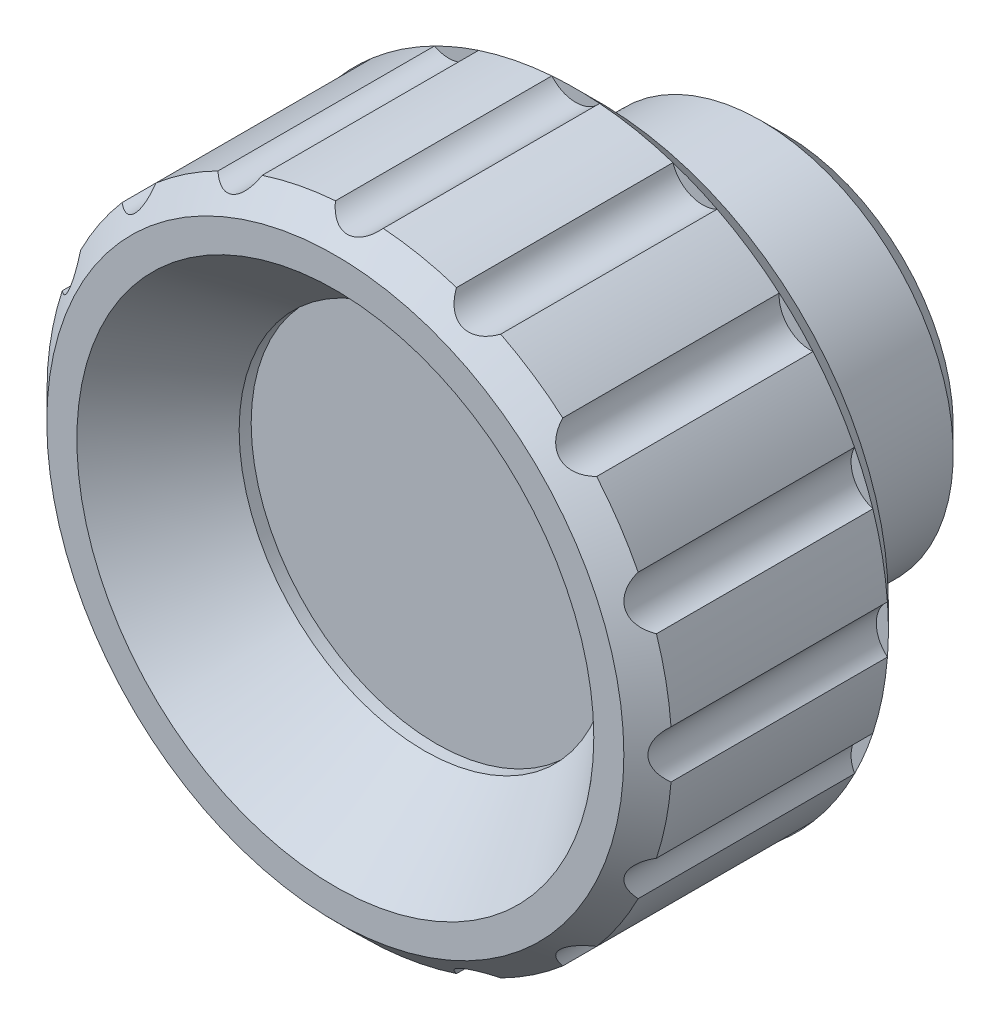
ISO-10303-21;
HEADER;
FILE_DESCRIPTION(('STEP AP214'),'2;1');
FILE_NAME('part.step','',(''),(''),'','','');
FILE_SCHEMA(('AUTOMOTIVE_DESIGN { 1 0 10303 214 1 1 1 1 }'));
ENDSEC;
DATA;
#1=APPLICATION_CONTEXT('core data for automotive mechanical design processes');
#2=APPLICATION_PROTOCOL_DEFINITION('international standard','automotive_design',2000,#1);
#3=PRODUCT_CONTEXT('',#1,'mechanical');
#4=PRODUCT('Part','Part','',(#3));
#5=PRODUCT_RELATED_PRODUCT_CATEGORY('part','',(#4));
#6=PRODUCT_DEFINITION_FORMATION('','',#4);
#7=PRODUCT_DEFINITION_CONTEXT('part definition',#1,'design');
#8=PRODUCT_DEFINITION('design','',#6,#7);
#9=PRODUCT_DEFINITION_SHAPE('','',#8);
#10=(LENGTH_UNIT() NAMED_UNIT(*) SI_UNIT(.MILLI.,.METRE.));
#11=(NAMED_UNIT(*) PLANE_ANGLE_UNIT() SI_UNIT($,.RADIAN.));
#12=(NAMED_UNIT(*) SI_UNIT($,.STERADIAN.) SOLID_ANGLE_UNIT());
#13=UNCERTAINTY_MEASURE_WITH_UNIT(LENGTH_MEASURE(1.E-05),#10,'distance_accuracy_value','');
#14=(GEOMETRIC_REPRESENTATION_CONTEXT(3) GLOBAL_UNCERTAINTY_ASSIGNED_CONTEXT((#13)) GLOBAL_UNIT_ASSIGNED_CONTEXT((#10,
#11,#12)) REPRESENTATION_CONTEXT('',''));
#15=CARTESIAN_POINT('',(0.,0.,0.));
#16=DIRECTION('',(0.,0.,1.));
#17=DIRECTION('',(1.,0.,0.));
#18=AXIS2_PLACEMENT_3D('',#15,#16,#17);
#19=CARTESIAN_POINT('',(-6.39920215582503E-13,-5.50485583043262E-13,7.99999999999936));
#20=DIRECTION('',(0.,0.,1.));
#21=DIRECTION('',(1.,0.,0.));
#22=AXIS2_PLACEMENT_3D('',#19,#20,#21);
#23=CYLINDRICAL_SURFACE('',#22,12.9999999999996);
#24=CARTESIAN_POINT('',(-1.43982048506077E-12,-1.23859256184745E-12,18.));
#25=DIRECTION('',(0.,0.,1.));
#26=DIRECTION('',(1.,0.,0.));
#27=AXIS2_PLACEMENT_3D('',#24,#25,#26);
#28=CIRCLE('',#27,12.9999999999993);
#29=CARTESIAN_POINT('',(-4.04215376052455,-12.3556057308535,17.9999999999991));
#30=VERTEX_POINT('',#29);
#31=CARTESIAN_POINT('',(-0.993822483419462,-12.9619565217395,17.9999999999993));
#32=VERTEX_POINT('',#31);
#33=EDGE_CURVE('E409',#30,#32,#28,.T.);
#34=ORIENTED_EDGE('',*,*,#33,.F.);
#35=DIRECTION('',(0.,0.,1.));
#36=VECTOR('',#35,1.);
#37=CARTESIAN_POINT('',(-4.04215376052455,-12.3556057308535,14.));
#38=LINE('',#37,#36);
#39=CARTESIAN_POINT('',(-4.04215376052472,-12.355605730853,9.));
#40=VERTEX_POINT('',#39);
#41=EDGE_CURVE('E615',#30,#40,#38,.F.);
#42=ORIENTED_EDGE('',*,*,#41,.T.);
#43=CARTESIAN_POINT('',(-7.19910242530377E-13,-6.19296280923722E-13,9.));
#44=DIRECTION('',(0.,0.,1.));
#45=DIRECTION('',(1.,0.,0.));
#46=AXIS2_PLACEMENT_3D('',#43,#44,#45);
#47=CIRCLE('',#46,13.);
#48=CARTESIAN_POINT('',(-0.993822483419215,-12.9619565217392,9.));
#49=VERTEX_POINT('',#48);
#50=EDGE_CURVE('E473',#40,#49,#47,.T.);
#51=ORIENTED_EDGE('',*,*,#50,.T.);
#52=DIRECTION('',(0.,0.,1.));
#53=VECTOR('',#52,1.);
#54=CARTESIAN_POINT('',(-0.993822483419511,-12.9619565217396,14.));
#55=LINE('',#54,#53);
#56=EDGE_CURVE('E583',#49,#32,#55,.T.);
#57=ORIENTED_EDGE('',*,*,#56,.T.);
#58=EDGE_LOOP('',(#34,#42,#51,#57));
#59=FACE_BOUND('',#58,.T.);
#60=ADVANCED_FACE('F14',(#59),#23,.T.);
#61=CARTESIAN_POINT('',(-8.46274873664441,-9.8682259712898,9.));
#62=VERTEX_POINT('',#61);
#63=CARTESIAN_POINT('',(-5.87849826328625,-11.5949669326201,9.));
#64=VERTEX_POINT('',#63);
#65=EDGE_CURVE('E483',#62,#64,#47,.T.);
#66=ORIENTED_EDGE('',*,*,#65,.T.);
#67=DIRECTION('',(0.,0.,1.));
#68=VECTOR('',#67,1.);
#69=CARTESIAN_POINT('',(-5.87849826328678,-11.5949669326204,14.));
#70=LINE('',#69,#68);
#71=CARTESIAN_POINT('',(-5.87849826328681,-11.5949669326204,17.999999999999));
#72=VERTEX_POINT('',#71);
#73=EDGE_CURVE('E613',#64,#72,#70,.T.);
#74=ORIENTED_EDGE('',*,*,#73,.T.);
#75=CARTESIAN_POINT('',(-8.46274873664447,-9.86822597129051,17.9999999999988));
#76=VERTEX_POINT('',#75);
#77=EDGE_CURVE('E405',#76,#72,#28,.T.);
#78=ORIENTED_EDGE('',*,*,#77,.F.);
#79=DIRECTION('',(0.,0.,1.));
#80=VECTOR('',#79,1.);
#81=CARTESIAN_POINT('',(-8.46274873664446,-9.86822597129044,14.));
#82=LINE('',#81,#80);
#83=EDGE_CURVE('E611',#76,#62,#82,.F.);
#84=ORIENTED_EDGE('',*,*,#83,.T.);
#85=EDGE_LOOP('',(#66,#74,#78,#84));
#86=FACE_BOUND('',#85,.T.);
#87=ADVANCED_FACE('F343',(#86),#23,.T.);
#88=CARTESIAN_POINT('',(-11.5949669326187,-5.87849826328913,9.));
#89=VERTEX_POINT('',#88);
#90=CARTESIAN_POINT('',(-9.86822597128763,-8.46274873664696,9.));
#91=VERTEX_POINT('',#90);
#92=EDGE_CURVE('E493',#89,#91,#47,.T.);
#93=ORIENTED_EDGE('',*,*,#92,.T.);
#94=DIRECTION('',(0.,0.,1.));
#95=VECTOR('',#94,1.);
#96=CARTESIAN_POINT('',(-9.86822597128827,-8.46274873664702,14.));
#97=LINE('',#96,#95);
#98=CARTESIAN_POINT('',(-9.86822597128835,-8.46274873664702,17.9999999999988));
#99=VERTEX_POINT('',#98);
#100=EDGE_CURVE('E609',#91,#99,#97,.T.);
#101=ORIENTED_EDGE('',*,*,#100,.T.);
#102=CARTESIAN_POINT('',(-11.594966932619,-5.87849826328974,17.9999999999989));
#103=VERTEX_POINT('',#102);
#104=EDGE_CURVE('E401',#103,#99,#28,.T.);
#105=ORIENTED_EDGE('',*,*,#104,.F.);
#106=DIRECTION('',(0.,0.,1.));
#107=VECTOR('',#106,1.);
#108=CARTESIAN_POINT('',(-11.594966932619,-5.87849826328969,14.));
#109=LINE('',#108,#107);
#110=EDGE_CURVE('E607',#103,#89,#109,.F.);
#111=ORIENTED_EDGE('',*,*,#110,.T.);
#112=EDGE_LOOP('',(#93,#101,#105,#111));
#113=FACE_BOUND('',#112,.T.);
#114=ADVANCED_FACE('F349',(#113),#23,.T.);
#115=CARTESIAN_POINT('',(-12.9619565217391,-0.993822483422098,9.));
#116=VERTEX_POINT('',#115);
#117=CARTESIAN_POINT('',(-12.355605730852,-4.04215376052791,9.));
#118=VERTEX_POINT('',#117);
#119=EDGE_CURVE('E504',#116,#118,#47,.T.);
#120=ORIENTED_EDGE('',*,*,#119,.T.);
#121=DIRECTION('',(0.,0.,1.));
#122=VECTOR('',#121,1.);
#123=CARTESIAN_POINT('',(-12.3556057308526,-4.04215376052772,14.));
#124=LINE('',#123,#122);
#125=CARTESIAN_POINT('',(-12.3556057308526,-4.04215376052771,17.999999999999));
#126=VERTEX_POINT('',#125);
#127=EDGE_CURVE('E605',#118,#126,#124,.T.);
#128=ORIENTED_EDGE('',*,*,#127,.T.);
#129=CARTESIAN_POINT('',(-12.9619565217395,-0.99382248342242,17.9999999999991));
#130=VERTEX_POINT('',#129);
#131=EDGE_CURVE('E397',#130,#126,#28,.T.);
#132=ORIENTED_EDGE('',*,*,#131,.F.);
#133=DIRECTION('',(0.,0.,1.));
#134=VECTOR('',#133,1.);
#135=CARTESIAN_POINT('',(-12.9619565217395,-0.993822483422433,14.));
#136=LINE('',#135,#134);
#137=EDGE_CURVE('E603',#130,#116,#136,.F.);
#138=ORIENTED_EDGE('',*,*,#137,.T.);
#139=EDGE_LOOP('',(#120,#128,#132,#138));
#140=FACE_BOUND('',#139,.T.);
#141=ADVANCED_FACE('F1090',(#140),#23,.T.);
#142=CARTESIAN_POINT('',(-12.3556057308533,4.0421537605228,9.));
#143=VERTEX_POINT('',#142);
#144=CARTESIAN_POINT('',(-12.9619565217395,0.993822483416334,9.));
#145=VERTEX_POINT('',#144);
#146=EDGE_CURVE('E515',#143,#145,#47,.T.);
#147=ORIENTED_EDGE('',*,*,#146,.T.);
#148=DIRECTION('',(0.,0.,1.));
#149=VECTOR('',#148,1.);
#150=CARTESIAN_POINT('',(-12.9619565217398,0.993822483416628,14.));
#151=LINE('',#150,#149);
#152=CARTESIAN_POINT('',(-12.9619565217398,0.99382248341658,17.9999999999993));
#153=VERTEX_POINT('',#152);
#154=EDGE_CURVE('E601',#145,#153,#151,.T.);
#155=ORIENTED_EDGE('',*,*,#154,.T.);
#156=CARTESIAN_POINT('',(-12.3556057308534,4.04215376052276,17.9999999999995));
#157=VERTEX_POINT('',#156);
#158=EDGE_CURVE('E393',#157,#153,#28,.T.);
#159=ORIENTED_EDGE('',*,*,#158,.F.);
#160=DIRECTION('',(0.,0.,1.));
#161=VECTOR('',#160,1.);
#162=CARTESIAN_POINT('',(-12.3556057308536,4.04215376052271,14.));
#163=LINE('',#162,#161);
#164=EDGE_CURVE('E599',#157,#143,#163,.F.);
#165=ORIENTED_EDGE('',*,*,#164,.T.);
#166=EDGE_LOOP('',(#147,#155,#159,#165));
#167=FACE_BOUND('',#166,.T.);
#168=ADVANCED_FACE('F1082',(#167),#23,.T.);
#169=CARTESIAN_POINT('',(-9.86822597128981,8.46274873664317,9.));
#170=VERTEX_POINT('',#169);
#171=CARTESIAN_POINT('',(-11.5949669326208,5.87849826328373,9.));
#172=VERTEX_POINT('',#171);
#173=EDGE_CURVE('E526',#170,#172,#47,.T.);
#174=ORIENTED_EDGE('',*,*,#173,.T.);
#175=DIRECTION('',(0.,0.,1.));
#176=VECTOR('',#175,1.);
#177=CARTESIAN_POINT('',(-11.5949669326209,5.87849826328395,14.));
#178=LINE('',#177,#176);
#179=CARTESIAN_POINT('',(-11.5949669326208,5.87849826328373,17.9999999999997));
#180=VERTEX_POINT('',#179);
#181=EDGE_CURVE('E597',#172,#180,#178,.T.);
#182=ORIENTED_EDGE('',*,*,#181,.T.);
#183=CARTESIAN_POINT('',(-9.86822597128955,8.46274873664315,18.));
#184=VERTEX_POINT('',#183);
#185=EDGE_CURVE('E389',#184,#180,#28,.T.);
#186=ORIENTED_EDGE('',*,*,#185,.F.);
#187=DIRECTION('',(0.,0.,1.));
#188=VECTOR('',#187,1.);
#189=CARTESIAN_POINT('',(-9.86822597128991,8.46274873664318,14.));
#190=LINE('',#189,#188);
#191=EDGE_CURVE('E595',#184,#170,#190,.F.);
#192=ORIENTED_EDGE('',*,*,#191,.T.);
#193=EDGE_LOOP('',(#174,#182,#186,#192));
#194=FACE_BOUND('',#193,.T.);
#195=ADVANCED_FACE('F1074',(#194),#23,.T.);
#196=CARTESIAN_POINT('',(-5.87849826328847,11.5949669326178,9.));
#197=VERTEX_POINT('',#196);
#198=CARTESIAN_POINT('',(-8.46274873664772,9.86822597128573,9.));
#199=VERTEX_POINT('',#198);
#200=EDGE_CURVE('E537',#197,#199,#47,.T.);
#201=ORIENTED_EDGE('',*,*,#200,.T.);
#202=DIRECTION('',(0.,0.,1.));
#203=VECTOR('',#202,1.);
#204=CARTESIAN_POINT('',(-8.46274873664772,9.86822597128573,14.));
#205=LINE('',#204,#203);
#206=CARTESIAN_POINT('',(-8.46274873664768,9.86822597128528,18.));
#207=VERTEX_POINT('',#206);
#208=EDGE_CURVE('E593',#199,#207,#205,.T.);
#209=ORIENTED_EDGE('',*,*,#208,.T.);
#210=CARTESIAN_POINT('',(-5.87849826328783,11.5949669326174,18.0000000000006));
#211=VERTEX_POINT('',#210);
#212=EDGE_CURVE('E385',#211,#207,#28,.T.);
#213=ORIENTED_EDGE('',*,*,#212,.F.);
#214=DIRECTION('',(0.,0.,1.));
#215=VECTOR('',#214,1.);
#216=CARTESIAN_POINT('',(-5.87849826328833,11.5949669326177,14.));
#217=LINE('',#216,#215);
#218=EDGE_CURVE('E591',#211,#197,#217,.F.);
#219=ORIENTED_EDGE('',*,*,#218,.T.);
#220=EDGE_LOOP('',(#201,#209,#213,#219));
#221=FACE_BOUND('',#220,.T.);
#222=ADVANCED_FACE('F1066',(#221),#23,.T.);
#223=CARTESIAN_POINT('',(-0.993822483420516,12.9619565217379,9.));
#224=VERTEX_POINT('',#223);
#225=CARTESIAN_POINT('',(-4.04215376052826,12.3556057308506,9.));
#226=VERTEX_POINT('',#225);
#227=EDGE_CURVE('E266',#224,#226,#47,.T.);
#228=ORIENTED_EDGE('',*,*,#227,.T.);
#229=DIRECTION('',(0.,0.,1.));
#230=VECTOR('',#229,1.);
#231=CARTESIAN_POINT('',(-4.04215376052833,12.3556057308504,14.));
#232=LINE('',#231,#230);
#233=CARTESIAN_POINT('',(-4.04215376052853,12.3556057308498,18.0000000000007));
#234=VERTEX_POINT('',#233);
#235=EDGE_CURVE('E557',#226,#234,#232,.T.);
#236=ORIENTED_EDGE('',*,*,#235,.T.);
#237=CARTESIAN_POINT('',(-0.993822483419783,12.961956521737,18.0000000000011));
#238=VERTEX_POINT('',#237);
#239=EDGE_CURVE('E382',#238,#234,#28,.T.);
#240=ORIENTED_EDGE('',*,*,#239,.F.);
#241=DIRECTION('',(0.,0.,1.));
#242=VECTOR('',#241,1.);
#243=CARTESIAN_POINT('',(-0.993822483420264,12.9619565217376,14.));
#244=LINE('',#243,#242);
#245=EDGE_CURVE('E558',#238,#224,#244,.F.);
#246=ORIENTED_EDGE('',*,*,#245,.T.);
#247=EDGE_LOOP('',(#228,#236,#240,#246));
#248=FACE_BOUND('',#247,.T.);
#249=ADVANCED_FACE('F556',(#248),#23,.T.);
#250=CARTESIAN_POINT('',(0.993822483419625,-12.9619565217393,17.9999999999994));
#251=VERTEX_POINT('',#250);
#252=CARTESIAN_POINT('',(4.0421537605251,-12.3556057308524,17.9999999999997));
#253=VERTEX_POINT('',#252);
#254=EDGE_CURVE('E412',#251,#253,#28,.T.);
#255=ORIENTED_EDGE('',*,*,#254,.F.);
#256=DIRECTION('',(0.,0.,1.));
#257=VECTOR('',#256,1.);
#258=CARTESIAN_POINT('',(0.993822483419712,-12.9619565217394,14.));
#259=LINE('',#258,#257);
#260=CARTESIAN_POINT('',(0.993822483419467,-12.9619565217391,9.));
#261=VERTEX_POINT('',#260);
#262=EDGE_CURVE('E585',#251,#261,#259,.F.);
#263=ORIENTED_EDGE('',*,*,#262,.T.);
#264=CARTESIAN_POINT('',(4.0421537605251,-12.3556057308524,9.));
#265=VERTEX_POINT('',#264);
#266=EDGE_CURVE('E462',#261,#265,#47,.T.);
#267=ORIENTED_EDGE('',*,*,#266,.T.);
#268=DIRECTION('',(0.,0.,1.));
#269=VECTOR('',#268,1.);
#270=CARTESIAN_POINT('',(4.04215376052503,-12.3556057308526,14.));
#271=LINE('',#270,#269);
#272=EDGE_CURVE('E579',#265,#253,#271,.T.);
#273=ORIENTED_EDGE('',*,*,#272,.T.);
#274=EDGE_LOOP('',(#255,#263,#267,#273));
#275=FACE_BOUND('',#274,.T.);
#276=ADVANCED_FACE('F1051',(#275),#23,.T.);
#277=CARTESIAN_POINT('',(5.87849826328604,-11.5949669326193,18.));
#278=VERTEX_POINT('',#277);
#279=CARTESIAN_POINT('',(8.4627487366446,-9.86822597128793,18.));
#280=VERTEX_POINT('',#279);
#281=EDGE_CURVE('E415',#278,#280,#28,.T.);
#282=ORIENTED_EDGE('',*,*,#281,.F.);
#283=DIRECTION('',(0.,0.,1.));
#284=VECTOR('',#283,1.);
#285=CARTESIAN_POINT('',(5.87849826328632,-11.5949669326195,14.));
#286=LINE('',#285,#284);
#287=CARTESIAN_POINT('',(5.87849826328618,-11.5949669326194,9.));
#288=VERTEX_POINT('',#287);
#289=EDGE_CURVE('E581',#278,#288,#286,.F.);
#290=ORIENTED_EDGE('',*,*,#289,.T.);
#291=CARTESIAN_POINT('',(8.46274873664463,-9.86822597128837,9.));
#292=VERTEX_POINT('',#291);
#293=EDGE_CURVE('E452',#288,#292,#47,.T.);
#294=ORIENTED_EDGE('',*,*,#293,.T.);
#295=DIRECTION('',(0.,0.,1.));
#296=VECTOR('',#295,1.);
#297=CARTESIAN_POINT('',(8.46274873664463,-9.86822597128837,14.));
#298=LINE('',#297,#296);
#299=EDGE_CURVE('E576',#292,#280,#298,.T.);
#300=ORIENTED_EDGE('',*,*,#299,.T.);
#301=EDGE_LOOP('',(#282,#290,#294,#300));
#302=FACE_BOUND('',#301,.T.);
#303=ADVANCED_FACE('F1036',(#302),#23,.T.);
#304=CARTESIAN_POINT('',(9.86822597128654,-8.46274873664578,18.0000000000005));
#305=VERTEX_POINT('',#304);
#306=CARTESIAN_POINT('',(11.594966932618,-5.87849826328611,18.0000000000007));
#307=VERTEX_POINT('',#306);
#308=EDGE_CURVE('E419',#305,#307,#28,.T.);
#309=ORIENTED_EDGE('',*,*,#308,.F.);
#310=DIRECTION('',(0.,0.,1.));
#311=VECTOR('',#310,1.);
#312=CARTESIAN_POINT('',(9.86822597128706,-8.46274873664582,14.));
#313=LINE('',#312,#311);
#314=CARTESIAN_POINT('',(9.86822597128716,-8.46274873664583,9.));
#315=VERTEX_POINT('',#314);
#316=EDGE_CURVE('E43',#305,#315,#313,.F.);
#317=ORIENTED_EDGE('',*,*,#316,.T.);
#318=CARTESIAN_POINT('',(11.5949669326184,-5.8784982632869,9.));
#319=VERTEX_POINT('',#318);
#320=EDGE_CURVE('E443',#315,#319,#47,.T.);
#321=ORIENTED_EDGE('',*,*,#320,.T.);
#322=DIRECTION('',(0.,0.,1.));
#323=VECTOR('',#322,1.);
#324=CARTESIAN_POINT('',(11.5949669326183,-5.87849826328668,14.));
#325=LINE('',#324,#323);
#326=EDGE_CURVE('E567',#319,#307,#325,.T.);
#327=ORIENTED_EDGE('',*,*,#326,.T.);
#328=EDGE_LOOP('',(#309,#317,#321,#327));
#329=FACE_BOUND('',#328,.T.);
#330=ADVANCED_FACE('F1030',(#329),#23,.T.);
#331=CARTESIAN_POINT('',(12.3556057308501,-4.04215376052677,18.0000000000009));
#332=VERTEX_POINT('',#331);
#333=CARTESIAN_POINT('',(12.9619565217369,-0.993822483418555,18.0000000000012));
#334=VERTEX_POINT('',#333);
#335=EDGE_CURVE('E422',#332,#334,#28,.T.);
#336=ORIENTED_EDGE('',*,*,#335,.F.);
#337=DIRECTION('',(0.,0.,1.));
#338=VECTOR('',#337,1.);
#339=CARTESIAN_POINT('',(12.3556057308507,-4.04215376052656,14.));
#340=LINE('',#339,#338);
#341=CARTESIAN_POINT('',(12.3556057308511,-4.04215376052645,9.));
#342=VERTEX_POINT('',#341);
#343=EDGE_CURVE('E35',#332,#342,#340,.F.);
#344=ORIENTED_EDGE('',*,*,#343,.T.);
#345=CARTESIAN_POINT('',(12.9619565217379,-0.993822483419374,9.));
#346=VERTEX_POINT('',#345);
#347=EDGE_CURVE('E433',#342,#346,#47,.T.);
#348=ORIENTED_EDGE('',*,*,#347,.T.);
#349=DIRECTION('',(0.,0.,1.));
#350=VECTOR('',#349,1.);
#351=CARTESIAN_POINT('',(12.9619565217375,-0.993822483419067,14.));
#352=LINE('',#351,#350);
#353=EDGE_CURVE('E568',#346,#334,#352,.T.);
#354=ORIENTED_EDGE('',*,*,#353,.T.);
#355=EDGE_LOOP('',(#336,#344,#348,#354));
#356=FACE_BOUND('',#355,.T.);
#357=ADVANCED_FACE('F1035',(#356),#23,.T.);
#358=CARTESIAN_POINT('',(12.9619565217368,0.993822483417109,18.0000000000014));
#359=VERTEX_POINT('',#358);
#360=CARTESIAN_POINT('',(12.3556057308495,4.04215376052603,18.0000000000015));
#361=VERTEX_POINT('',#360);
#362=EDGE_CURVE('E274',#359,#361,#28,.T.);
#363=ORIENTED_EDGE('',*,*,#362,.F.);
#364=DIRECTION('',(0.,0.,1.));
#365=VECTOR('',#364,1.);
#366=CARTESIAN_POINT('',(12.9619565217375,0.993822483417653,14.));
#367=LINE('',#366,#365);
#368=CARTESIAN_POINT('',(12.9619565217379,0.993822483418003,9.));
#369=VERTEX_POINT('',#368);
#370=EDGE_CURVE('E565',#359,#369,#367,.F.);
#371=ORIENTED_EDGE('',*,*,#370,.T.);
#372=CARTESIAN_POINT('',(12.3556057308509,4.04215376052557,9.));
#373=VERTEX_POINT('',#372);
#374=EDGE_CURVE('E267',#369,#373,#47,.T.);
#375=ORIENTED_EDGE('',*,*,#374,.T.);
#376=DIRECTION('',(0.,0.,1.));
#377=VECTOR('',#376,1.);
#378=CARTESIAN_POINT('',(12.3556057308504,4.04215376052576,14.));
#379=LINE('',#378,#377);
#380=EDGE_CURVE('E564',#373,#361,#379,.T.);
#381=ORIENTED_EDGE('',*,*,#380,.T.);
#382=EDGE_LOOP('',(#363,#371,#375,#381));
#383=FACE_BOUND('',#382,.T.);
#384=ADVANCED_FACE('F371',(#383),#23,.T.);
#385=CARTESIAN_POINT('',(11.5949669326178,5.87849826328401,18.0000000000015));
#386=VERTEX_POINT('',#385);
#387=CARTESIAN_POINT('',(9.86822597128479,8.46274873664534,18.0000000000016));
#388=VERTEX_POINT('',#387);
#389=EDGE_CURVE('E380',#386,#388,#28,.T.);
#390=ORIENTED_EDGE('',*,*,#389,.F.);
#391=DIRECTION('',(0.,0.,1.));
#392=VECTOR('',#391,1.);
#393=CARTESIAN_POINT('',(11.5949669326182,5.87849826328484,14.));
#394=LINE('',#393,#392);
#395=CARTESIAN_POINT('',(11.5949669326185,5.87849826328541,9.));
#396=VERTEX_POINT('',#395);
#397=EDGE_CURVE('E571',#386,#396,#394,.F.);
#398=ORIENTED_EDGE('',*,*,#397,.T.);
#399=CARTESIAN_POINT('',(9.8682259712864,8.46274873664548,9.));
#400=VERTEX_POINT('',#399);
#401=EDGE_CURVE('E1167',#396,#400,#47,.T.);
#402=ORIENTED_EDGE('',*,*,#401,.T.);
#403=DIRECTION('',(0.,0.,1.));
#404=VECTOR('',#403,1.);
#405=CARTESIAN_POINT('',(9.86822597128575,8.46274873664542,14.));
#406=LINE('',#405,#404);
#407=EDGE_CURVE('E258',#400,#388,#406,.T.);
#408=ORIENTED_EDGE('',*,*,#407,.T.);
#409=EDGE_LOOP('',(#390,#398,#402,#408));
#410=FACE_BOUND('',#409,.T.);
#411=ADVANCED_FACE('F361',(#410),#23,.T.);
#412=CARTESIAN_POINT('',(8.46274873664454,9.8682259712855,18.0000000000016));
#413=VERTEX_POINT('',#412);
#414=CARTESIAN_POINT('',(5.87849826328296,11.5949669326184,18.0000000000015));
#415=VERTEX_POINT('',#414);
#416=EDGE_CURVE('E376',#413,#415,#28,.T.);
#417=ORIENTED_EDGE('',*,*,#416,.F.);
#418=DIRECTION('',(0.,0.,1.));
#419=VECTOR('',#418,1.);
#420=CARTESIAN_POINT('',(8.46274873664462,9.86822597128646,14.));
#421=LINE('',#420,#419);
#422=CARTESIAN_POINT('',(8.46274873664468,9.8682259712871,9.));
#423=VERTEX_POINT('',#422);
#424=EDGE_CURVE('E377',#413,#423,#421,.F.);
#425=ORIENTED_EDGE('',*,*,#424,.T.);
#426=CARTESIAN_POINT('',(5.87849826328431,11.5949669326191,9.));
#427=VERTEX_POINT('',#426);
#428=EDGE_CURVE('E239',#423,#427,#47,.T.);
#429=ORIENTED_EDGE('',*,*,#428,.T.);
#430=DIRECTION('',(0.,0.,1.));
#431=VECTOR('',#430,1.);
#432=CARTESIAN_POINT('',(5.87849826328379,11.5949669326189,14.));
#433=LINE('',#432,#431);
#434=EDGE_CURVE('E248',#427,#415,#433,.T.);
#435=ORIENTED_EDGE('',*,*,#434,.T.);
#436=EDGE_LOOP('',(#417,#425,#429,#435));
#437=FACE_BOUND('',#436,.T.);
#438=ADVANCED_FACE('F354',(#437),#23,.T.);
#439=CARTESIAN_POINT('',(10.2499999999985,-1.30740325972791E-12,19.0000000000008));
#440=DIRECTION('',(0.,0.,1.));
#441=DIRECTION('',(0.,-1.,0.));
#442=AXIS2_PLACEMENT_3D('',#439,#440,#441);
#443=PLANE('',#442);
#444=CARTESIAN_POINT('',(-1.51981051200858E-12,-1.30740325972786E-12,19.));
#445=DIRECTION('',(0.,0.,1.));
#446=DIRECTION('',(1.,0.,0.));
#447=AXIS2_PLACEMENT_3D('',#444,#445,#446);
#448=CIRCLE('',#447,11.9999999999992);
#449=CARTESIAN_POINT('',(11.9999999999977,-1.30740325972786E-12,19.000000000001));
#450=VERTEX_POINT('',#449);
#451=EDGE_CURVE('E425',#450,#450,#448,.T.);
#452=ORIENTED_EDGE('',*,*,#451,.T.);
#453=EDGE_LOOP('',(#452));
#454=FACE_BOUND('',#453,.T.);
#455=CARTESIAN_POINT('',(-1.51981051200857E-12,-1.30740325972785E-12,19.));
#456=DIRECTION('',(0.,0.,1.));
#457=DIRECTION('',(1.,0.,0.));
#458=AXIS2_PLACEMENT_3D('',#455,#456,#457);
#459=CIRCLE('',#458,10.75);
#460=CARTESIAN_POINT('',(10.7499999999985,-1.30740325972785E-12,19.0000000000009));
#461=VERTEX_POINT('',#460);
#462=EDGE_CURVE('E429',#461,#461,#459,.T.);
#463=ORIENTED_EDGE('',*,*,#462,.F.);
#464=EDGE_LOOP('',(#463));
#465=FACE_BOUND('',#464,.T.);
#466=ADVANCED_FACE('F360',(#454,#465),#443,.T.);
#467=CARTESIAN_POINT('',(7.,0.,0.30000000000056));
#468=DIRECTION('',(0.,0.,-1.));
#469=DIRECTION('',(0.,1.,0.));
#470=AXIS2_PLACEMENT_3D('',#467,#468,#469);
#471=PLANE('',#470);
#472=CARTESIAN_POINT('',(0.,0.,0.3));
#473=DIRECTION('',(0.,0.,-1.));
#474=DIRECTION('',(0.,1.,0.));
#475=AXIS2_PLACEMENT_3D('',#472,#473,#474);
#476=CIRCLE('',#475,7.);
#477=CARTESIAN_POINT('',(0.,6.99999999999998,0.300000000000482));
#478=VERTEX_POINT('',#477);
#479=EDGE_CURVE('E285',#478,#478,#476,.T.);
#480=ORIENTED_EDGE('',*,*,#479,.T.);
#481=EDGE_LOOP('',(#480));
#482=FACE_BOUND('',#481,.T.);
#483=CARTESIAN_POINT('',(0.,0.,0.3));
#484=DIRECTION('',(0.,0.,-1.));
#485=DIRECTION('',(-1.,0.,0.));
#486=AXIS2_PLACEMENT_3D('',#483,#484,#485);
#487=CIRCLE('',#486,4.);
#488=CARTESIAN_POINT('',(-4.00000000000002,0.,0.29999999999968));
#489=VERTEX_POINT('',#488);
#490=EDGE_CURVE('E281',#489,#489,#487,.T.);
#491=ORIENTED_EDGE('',*,*,#490,.F.);
#492=EDGE_LOOP('',(#491));
#493=FACE_BOUND('',#492,.T.);
#494=ADVANCED_FACE('F368',(#482,#493),#471,.T.);
#495=CARTESIAN_POINT('',(11.4999999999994,-5.50485583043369E-13,8.00000000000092));
#496=DIRECTION('',(0.,0.,-1.));
#497=DIRECTION('',(0.,1.,0.));
#498=AXIS2_PLACEMENT_3D('',#495,#496,#497);
#499=PLANE('',#498);
#500=CARTESIAN_POINT('',(-6.39920215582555E-13,-5.50485583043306E-13,8.));
#501=DIRECTION('',(0.,0.,-1.));
#502=DIRECTION('',(0.,1.,0.));
#503=AXIS2_PLACEMENT_3D('',#500,#501,#502);
#504=CIRCLE('',#503,8.);
#505=CARTESIAN_POINT('',(-6.39920215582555E-13,7.99999999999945,8.00000000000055));
#506=VERTEX_POINT('',#505);
#507=EDGE_CURVE('E293',#506,#506,#504,.T.);
#508=ORIENTED_EDGE('',*,*,#507,.F.);
#509=EDGE_LOOP('',(#508));
#510=FACE_BOUND('',#509,.T.);
#511=CARTESIAN_POINT('',(-6.39920215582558E-13,-5.50485583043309E-13,8.));
#512=DIRECTION('',(0.,0.,1.));
#513=DIRECTION('',(1.,0.,0.));
#514=AXIS2_PLACEMENT_3D('',#511,#512,#513);
#515=CIRCLE('',#514,12.);
#516=CARTESIAN_POINT('',(11.9999999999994,-5.50485583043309E-13,8.00000000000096));
#517=VERTEX_POINT('',#516);
#518=EDGE_CURVE('E271',#517,#517,#515,.T.);
#519=ORIENTED_EDGE('',*,*,#518,.F.);
#520=EDGE_LOOP('',(#519));
#521=FACE_BOUND('',#520,.T.);
#522=ADVANCED_FACE('F632',(#510,#521),#499,.T.);
#523=CARTESIAN_POINT('',(0.,0.,0.3));
#524=DIRECTION('',(0.,0.,-1.));
#525=DIRECTION('',(0.,1.,0.));
#526=AXIS2_PLACEMENT_3D('',#523,#524,#525);
#527=CYLINDRICAL_SURFACE('',#526,8.);
#528=ORIENTED_EDGE('',*,*,#507,.T.);
#529=EDGE_LOOP('',(#528));
#530=FACE_BOUND('',#529,.T.);
#531=CARTESIAN_POINT('',(-1.03987035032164E-13,0.,1.3));
#532=DIRECTION('',(0.,0.,-1.));
#533=DIRECTION('',(0.,1.,0.));
#534=AXIS2_PLACEMENT_3D('',#531,#532,#533);
#535=CIRCLE('',#534,8.);
#536=CARTESIAN_POINT('',(-1.03987035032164E-13,7.99999999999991,1.30000000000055));
#537=VERTEX_POINT('',#536);
#538=EDGE_CURVE('E290',#537,#537,#535,.T.);
#539=ORIENTED_EDGE('',*,*,#538,.F.);
#540=EDGE_LOOP('',(#539));
#541=FACE_BOUND('',#540,.T.);
#542=ADVANCED_FACE('F635',(#530,#541),#527,.T.);
#543=CARTESIAN_POINT('',(0.,0.,0.3));
#544=DIRECTION('',(0.,0.,1.));
#545=DIRECTION('',(0.,-1.,0.));
#546=AXIS2_PLACEMENT_3D('',#543,#544,#545);
#547=CONICAL_SURFACE('',#546,7.,0.785398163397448);
#548=ORIENTED_EDGE('',*,*,#538,.T.);
#549=EDGE_LOOP('',(#548));
#550=FACE_BOUND('',#549,.T.);
#551=ORIENTED_EDGE('',*,*,#479,.F.);
#552=EDGE_LOOP('',(#551));
#553=FACE_BOUND('',#552,.T.);
#554=ADVANCED_FACE('F639',(#550,#553),#547,.T.);
#555=CARTESIAN_POINT('',(0.,0.,0.));
#556=DIRECTION('',(0.,0.,-1.));
#557=DIRECTION('',(-1.,0.,0.));
#558=AXIS2_PLACEMENT_3D('',#555,#556,#557);
#559=PLANE('',#558);
#560=CARTESIAN_POINT('',(0.,0.,0.));
#561=DIRECTION('',(0.,0.,-1.));
#562=DIRECTION('',(-1.,0.,0.));
#563=AXIS2_PLACEMENT_3D('',#560,#561,#562);
#564=CIRCLE('',#563,3.45);
#565=CARTESIAN_POINT('',(-3.45,0.,-2.75965592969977E-13));
#566=VERTEX_POINT('',#565);
#567=EDGE_CURVE('E302',#566,#566,#564,.F.);
#568=ORIENTED_EDGE('',*,*,#567,.T.);
#569=EDGE_LOOP('',(#568));
#570=FACE_BOUND('',#569,.T.);
#571=CARTESIAN_POINT('',(0.,0.,0.));
#572=DIRECTION('',(0.,0.,-1.));
#573=DIRECTION('',(-1.,0.,0.));
#574=AXIS2_PLACEMENT_3D('',#571,#572,#573);
#575=CIRCLE('',#574,4.);
#576=CARTESIAN_POINT('',(-4.,0.,-3.19960107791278E-13));
#577=VERTEX_POINT('',#576);
#578=EDGE_CURVE('E282',#577,#577,#575,.T.);
#579=ORIENTED_EDGE('',*,*,#578,.T.);
#580=EDGE_LOOP('',(#579));
#581=FACE_BOUND('',#580,.T.);
#582=ADVANCED_FACE('F643',(#570,#581),#559,.T.);
#583=CARTESIAN_POINT('',(0.,0.,0.));
#584=DIRECTION('',(0.,0.,1.));
#585=DIRECTION('',(1.,0.,0.));
#586=AXIS2_PLACEMENT_3D('',#583,#584,#585);
#587=CYLINDRICAL_SURFACE('',#586,4.);
#588=ORIENTED_EDGE('',*,*,#578,.F.);
#589=EDGE_LOOP('',(#588));
#590=FACE_BOUND('',#589,.T.);
#591=ORIENTED_EDGE('',*,*,#490,.T.);
#592=EDGE_LOOP('',(#591));
#593=FACE_BOUND('',#592,.T.);
#594=ADVANCED_FACE('F648',(#590,#593),#587,.T.);
#595=CARTESIAN_POINT('',(-6.39920215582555E-13,-5.50485583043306E-13,8.));
#596=DIRECTION('',(0.,0.,-1.));
#597=DIRECTION('',(-1.,0.,0.));
#598=AXIS2_PLACEMENT_3D('',#595,#596,#597);
#599=CYLINDRICAL_SURFACE('',#598,3.);
#600=CARTESIAN_POINT('',(0.,0.,0.45));
#601=DIRECTION('',(0.,0.,-1.));
#602=DIRECTION('',(-1.,0.,0.));
#603=AXIS2_PLACEMENT_3D('',#600,#601,#602);
#604=CIRCLE('',#603,3.);
#605=CARTESIAN_POINT('',(-3.00000000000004,0.,0.44999999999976));
#606=VERTEX_POINT('',#605);
#607=EDGE_CURVE('E299',#606,#606,#604,.T.);
#608=ORIENTED_EDGE('',*,*,#607,.T.);
#609=EDGE_LOOP('',(#608));
#610=FACE_BOUND('',#609,.T.);
#611=CARTESIAN_POINT('',(-6.39920215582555E-13,-5.50485583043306E-13,8.));
#612=DIRECTION('',(0.,0.,-1.));
#613=DIRECTION('',(-1.,0.,0.));
#614=AXIS2_PLACEMENT_3D('',#611,#612,#613);
#615=CIRCLE('',#614,3.);
#616=CARTESIAN_POINT('',(-3.00000000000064,-5.50485583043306E-13,7.99999999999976));
#617=VERTEX_POINT('',#616);
#618=EDGE_CURVE('E278',#617,#617,#615,.T.);
#619=ORIENTED_EDGE('',*,*,#618,.F.);
#620=EDGE_LOOP('',(#619));
#621=FACE_BOUND('',#620,.T.);
#622=ADVANCED_FACE('F651',(#610,#621),#599,.F.);
#623=CARTESIAN_POINT('',(-6.39920215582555E-13,-5.50485583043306E-13,8.));
#624=DIRECTION('',(0.,0.,-1.));
#625=DIRECTION('',(-1.,0.,0.));
#626=AXIS2_PLACEMENT_3D('',#623,#624,#625);
#627=PLANE('',#626);
#628=ORIENTED_EDGE('',*,*,#618,.T.);
#629=EDGE_LOOP('',(#628));
#630=FACE_BOUND('',#629,.T.);
#631=ADVANCED_FACE('F658',(#630),#627,.T.);
#632=CARTESIAN_POINT('',(0.,0.,0.45));
#633=DIRECTION('',(0.,0.,-1.));
#634=DIRECTION('',(-1.,0.,0.));
#635=AXIS2_PLACEMENT_3D('',#632,#633,#634);
#636=CONICAL_SURFACE('',#635,3.,0.785398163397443);
#637=ORIENTED_EDGE('',*,*,#567,.F.);
#638=EDGE_LOOP('',(#637));
#639=FACE_BOUND('',#638,.T.);
#640=ORIENTED_EDGE('',*,*,#607,.F.);
#641=EDGE_LOOP('',(#640));
#642=FACE_BOUND('',#641,.T.);
#643=ADVANCED_FACE('F16',(#639,#642),#636,.F.);
#644=CARTESIAN_POINT('',(-6.39920215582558E-13,-5.50485583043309E-13,8.));
#645=DIRECTION('',(0.,0.,1.));
#646=DIRECTION('',(1.,0.,0.));
#647=AXIS2_PLACEMENT_3D('',#644,#645,#646);
#648=CONICAL_SURFACE('',#647,12.,0.785398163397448);
#649=ORIENTED_EDGE('',*,*,#374,.F.);
#650=EDGE_CURVE('E273',#346,#369,#47,.T.);
#651=ORIENTED_EDGE('',*,*,#650,.F.);
#652=ORIENTED_EDGE('',*,*,#347,.F.);
#653=EDGE_CURVE('E439',#319,#342,#47,.T.);
#654=ORIENTED_EDGE('',*,*,#653,.F.);
#655=ORIENTED_EDGE('',*,*,#320,.F.);
#656=EDGE_CURVE('E448',#292,#315,#47,.T.);
#657=ORIENTED_EDGE('',*,*,#656,.F.);
#658=ORIENTED_EDGE('',*,*,#293,.F.);
#659=EDGE_CURVE('E457',#265,#288,#47,.T.);
#660=ORIENTED_EDGE('',*,*,#659,.F.);
#661=ORIENTED_EDGE('',*,*,#266,.F.);
#662=EDGE_CURVE('E468',#49,#261,#47,.T.);
#663=ORIENTED_EDGE('',*,*,#662,.F.);
#664=ORIENTED_EDGE('',*,*,#50,.F.);
#665=EDGE_CURVE('E479',#64,#40,#47,.T.);
#666=ORIENTED_EDGE('',*,*,#665,.F.);
#667=ORIENTED_EDGE('',*,*,#65,.F.);
#668=EDGE_CURVE('E489',#91,#62,#47,.T.);
#669=ORIENTED_EDGE('',*,*,#668,.F.);
#670=ORIENTED_EDGE('',*,*,#92,.F.);
#671=EDGE_CURVE('E499',#118,#89,#47,.T.);
#672=ORIENTED_EDGE('',*,*,#671,.F.);
#673=ORIENTED_EDGE('',*,*,#119,.F.);
#674=EDGE_CURVE('E510',#145,#116,#47,.T.);
#675=ORIENTED_EDGE('',*,*,#674,.F.);
#676=ORIENTED_EDGE('',*,*,#146,.F.);
#677=EDGE_CURVE('E521',#172,#143,#47,.T.);
#678=ORIENTED_EDGE('',*,*,#677,.F.);
#679=ORIENTED_EDGE('',*,*,#173,.F.);
#680=EDGE_CURVE('E532',#199,#170,#47,.T.);
#681=ORIENTED_EDGE('',*,*,#680,.F.);
#682=ORIENTED_EDGE('',*,*,#200,.F.);
#683=EDGE_CURVE('E543',#226,#197,#47,.T.);
#684=ORIENTED_EDGE('',*,*,#683,.F.);
#685=ORIENTED_EDGE('',*,*,#227,.F.);
#686=CARTESIAN_POINT('',(0.993822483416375,12.9619565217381,9.));
#687=VERTEX_POINT('',#686);
#688=EDGE_CURVE('E265',#687,#224,#47,.T.);
#689=ORIENTED_EDGE('',*,*,#688,.F.);
#690=CARTESIAN_POINT('',(4.0421537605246,12.3556057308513,9.));
#691=VERTEX_POINT('',#690);
#692=EDGE_CURVE('E240',#691,#687,#47,.T.);
#693=ORIENTED_EDGE('',*,*,#692,.F.);
#694=EDGE_CURVE('E231',#427,#691,#47,.T.);
#695=ORIENTED_EDGE('',*,*,#694,.F.);
#696=ORIENTED_EDGE('',*,*,#428,.F.);
#697=EDGE_CURVE('E1170',#400,#423,#47,.T.);
#698=ORIENTED_EDGE('',*,*,#697,.F.);
#699=ORIENTED_EDGE('',*,*,#401,.F.);
#700=EDGE_CURVE('E272',#373,#396,#47,.T.);
#701=ORIENTED_EDGE('',*,*,#700,.F.);
#702=EDGE_LOOP('',(#649,#651,#652,#654,#655,#657,#658,#660,#661,#663,#664,#666,#667,#669,#670,
#672,#673,#675,#676,#678,#679,#681,#682,#684,#685,#689,#693,#695,#696,#698,#699,#701));
#703=FACE_BOUND('',#702,.T.);
#704=ORIENTED_EDGE('',*,*,#518,.T.);
#705=EDGE_LOOP('',(#704));
#706=FACE_BOUND('',#705,.T.);
#707=ADVANCED_FACE('F262',(#703,#706),#648,.T.);
#708=ORIENTED_EDGE('',*,*,#692,.T.);
#709=DIRECTION('',(0.,0.,1.));
#710=VECTOR('',#709,1.);
#711=CARTESIAN_POINT('',(0.993822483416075,12.9619565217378,14.));
#712=LINE('',#711,#710);
#713=CARTESIAN_POINT('',(0.993822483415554,12.9619565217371,18.0000000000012));
#714=VERTEX_POINT('',#713);
#715=EDGE_CURVE('E587',#687,#714,#712,.T.);
#716=ORIENTED_EDGE('',*,*,#715,.T.);
#717=CARTESIAN_POINT('',(4.04215376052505,12.35560573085,18.0000000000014));
#718=VERTEX_POINT('',#717);
#719=EDGE_CURVE('E257',#718,#714,#28,.T.);
#720=ORIENTED_EDGE('',*,*,#719,.F.);
#721=DIRECTION('',(0.,0.,1.));
#722=VECTOR('',#721,1.);
#723=CARTESIAN_POINT('',(4.04215376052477,12.3556057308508,14.));
#724=LINE('',#723,#722);
#725=EDGE_CURVE('E245',#718,#691,#724,.F.);
#726=ORIENTED_EDGE('',*,*,#725,.T.);
#727=EDGE_LOOP('',(#708,#716,#720,#726));
#728=FACE_BOUND('',#727,.T.);
#729=ADVANCED_FACE('F254',(#728),#23,.T.);
#730=CARTESIAN_POINT('',(-1.43982048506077E-12,-1.23859256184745E-12,18.));
#731=DIRECTION('',(0.,0.,-1.));
#732=DIRECTION('',(-1.,0.,0.));
#733=AXIS2_PLACEMENT_3D('',#730,#731,#732);
#734=CONICAL_SURFACE('',#733,12.9999999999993,0.785398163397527);
#735=ORIENTED_EDGE('',*,*,#451,.F.);
#736=EDGE_LOOP('',(#735));
#737=FACE_BOUND('',#736,.T.);
#738=ORIENTED_EDGE('',*,*,#77,.T.);
#739=CARTESIAN_POINT('',(-5.87871711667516,-11.5950802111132,17.9997999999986));
#740=CARTESIAN_POINT('',(-5.84928597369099,-11.5798521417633,18.0266898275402));
#741=CARTESIAN_POINT('',(-5.81895371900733,-11.5655672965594,18.0531049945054));
#742=CARTESIAN_POINT('',(-5.75637175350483,-11.5390770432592,18.1048217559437));
#743=CARTESIAN_POINT('',(-5.72411817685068,-11.5268760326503,18.1301209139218));
#744=CARTESIAN_POINT('',(-5.62378947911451,-11.4935463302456,18.2044510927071));
#745=CARTESIAN_POINT('',(-5.5527675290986,-11.4760237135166,18.251335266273));
#746=CARTESIAN_POINT('',(-5.42531861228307,-11.4564586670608,18.3239368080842));
#747=CARTESIAN_POINT('',(-5.37060424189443,-11.4514062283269,18.3518558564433));
#748=CARTESIAN_POINT('',(-5.25848601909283,-11.4485329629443,18.4016637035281));
#749=CARTESIAN_POINT('',(-5.20109495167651,-11.4506806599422,18.4235782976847));
#750=CARTESIAN_POINT('',(-5.09393831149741,-11.4621269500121,18.4570191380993));
#751=CARTESIAN_POINT('',(-5.04439157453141,-11.4702488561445,18.4696366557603));
#752=CARTESIAN_POINT('',(-4.94543096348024,-11.4925807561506,18.4886362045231));
#753=CARTESIAN_POINT('',(-4.89601708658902,-11.5067906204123,18.4950183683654));
#754=CARTESIAN_POINT('',(-4.7987373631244,-11.5412079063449,18.5010119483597));
#755=CARTESIAN_POINT('',(-4.75087591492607,-11.5614309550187,18.5006055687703));
#756=CARTESIAN_POINT('',(-4.65835169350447,-11.6071997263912,18.4930150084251));
#757=CARTESIAN_POINT('',(-4.61368935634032,-11.6327461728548,18.4858299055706));
#758=CARTESIAN_POINT('',(-4.53038775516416,-11.6870353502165,18.4656900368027));
#759=CARTESIAN_POINT('',(-4.49158013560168,-11.7156116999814,18.4529747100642));
#760=CARTESIAN_POINT('',(-4.41848432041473,-11.7757528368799,18.4226654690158));
#761=CARTESIAN_POINT('',(-4.38419765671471,-11.8073186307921,18.4050699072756));
#762=CARTESIAN_POINT('',(-4.30512735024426,-11.8880598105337,18.3565675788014));
#763=CARTESIAN_POINT('',(-4.26307152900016,-11.9384900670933,18.3233046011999));
#764=CARTESIAN_POINT('',(-4.18858929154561,-12.0419659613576,18.2504718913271));
#765=CARTESIAN_POINT('',(-4.15619325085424,-12.0950192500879,18.2108828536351));
#766=CARTESIAN_POINT('',(-4.11040101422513,-12.1828671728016,18.1424390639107));
#767=CARTESIAN_POINT('',(-4.0943681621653,-12.2173373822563,18.1148701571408));
#768=CARTESIAN_POINT('',(-4.06572380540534,-12.2864807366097,18.0583181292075));
#769=CARTESIAN_POINT('',(-4.05310887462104,-12.3211536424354,18.0293364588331));
#770=CARTESIAN_POINT('',(-4.04207910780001,-12.3558405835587,17.9997999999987));
#771=B_SPLINE_CURVE_WITH_KNOTS('',3,(#739,#740,#741,#742,#743,#744,#745,#746,#747,#748,#749,
#750,#751,#752,#753,#754,#755,#756,#757,#758,#759,#760,#761,#762,#763,#764,#765,#766,#767,#768,
#769,#770),.UNSPECIFIED.,.F.,.F.,(4,2,2,2,2,2,2,2,2,2,2,2,2,2,2,4),(0.,0.127963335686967,
0.256193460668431,0.51536582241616,0.69964989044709,0.883129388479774,1.03777780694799,
1.19242293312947,1.34747351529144,1.50254519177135,1.65148353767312,1.80047222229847,
2.02008153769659,2.24037431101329,2.38112116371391,2.5217264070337),.UNSPECIFIED.);
#772=EDGE_CURVE('E9',#72,#30,#771,.T.);
#773=ORIENTED_EDGE('',*,*,#772,.T.);
#774=ORIENTED_EDGE('',*,*,#33,.T.);
#775=CARTESIAN_POINT('',(-0.993981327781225,-12.962144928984,17.9998000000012));
#776=CARTESIAN_POINT('',(-0.972618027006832,-12.9368132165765,18.0266898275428));
#777=CARTESIAN_POINT('',(-0.950061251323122,-12.9120080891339,18.0531049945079));
#778=CARTESIAN_POINT('',(-0.902380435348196,-12.8635852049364,18.1048217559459));
#779=CARTESIAN_POINT('',(-0.877251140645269,-12.839970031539,18.130120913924));
#780=CARTESIAN_POINT('',(-0.797314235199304,-12.7707832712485,18.2044510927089));
#781=CARTESIAN_POINT('',(-0.738404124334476,-12.7274155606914,18.2513352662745));
#782=CARTESIAN_POINT('',(-0.628143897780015,-12.6605672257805,18.3239368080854));
#783=CARTESIAN_POINT('',(-0.579527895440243,-12.634961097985,18.3518558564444));
#784=CARTESIAN_POINT('',(-0.477043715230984,-12.5894007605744,18.401663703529));
#785=CARTESIAN_POINT('',(-0.423199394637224,-12.5694223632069,18.4235782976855));
#786=CARTESIAN_POINT('',(-0.319819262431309,-12.5389902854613,18.4570191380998));
#787=CARTESIAN_POINT('',(-0.270935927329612,-12.5275332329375,18.4696366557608));
#788=CARTESIAN_POINT('',(-0.170962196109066,-12.5102946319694,18.4886362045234));
#789=CARTESIAN_POINT('',(-0.119871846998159,-12.5045129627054,18.4950183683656));
#790=CARTESIAN_POINT('',(-0.0168261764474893,-12.4990830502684,18.5010119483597));
#791=CARTESIAN_POINT('',(0.0351310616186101,-12.4994509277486,18.5006055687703));
#792=CARTESIAN_POINT('',(0.138127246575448,-12.5063282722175,18.493015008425));
#793=CARTESIAN_POINT('',(0.189166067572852,-12.5128385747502,18.4858299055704));
#794=CARTESIAN_POINT('',(0.286902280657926,-12.5311170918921,18.4656900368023));
#795=CARTESIAN_POINT('',(0.333691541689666,-12.5426671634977,18.4529747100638));
#796=CARTESIAN_POINT('',(0.424238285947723,-12.570257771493,18.4226654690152));
#797=CARTESIAN_POINT('',(0.467994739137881,-12.586299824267,18.405069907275));
#798=CARTESIAN_POINT('',(0.571944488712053,-12.630636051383,18.3565675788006));
#799=CARTESIAN_POINT('',(0.63009782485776,-12.6611334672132,18.323304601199));
#800=CARTESIAN_POINT('',(0.73850894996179,-12.7282296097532,18.2504718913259));
#801=CARTESIAN_POINT('',(0.788741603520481,-12.7648470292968,18.2108828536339));
#802=CARTESIAN_POINT('',(0.864666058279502,-12.8284839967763,18.1424390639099));
#803=CARTESIAN_POINT('',(0.892669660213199,-12.8541948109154,18.1148701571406));
#804=CARTESIAN_POINT('',(0.945593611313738,-12.9071132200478,18.0583181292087));
#805=CARTESIAN_POINT('',(0.970517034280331,-12.9343192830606,18.0293364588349));
#806=CARTESIAN_POINT('',(0.993981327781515,-12.9621449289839,17.9998000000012));
#807=B_SPLINE_CURVE_WITH_KNOTS('',3,(#775,#776,#777,#778,#779,#780,#781,#782,#783,#784,#785,
#786,#787,#788,#789,#790,#791,#792,#793,#794,#795,#796,#797,#798,#799,#800,#801,#802,#803,#804,
#805,#806),.UNSPECIFIED.,.F.,.F.,(4,2,2,2,2,2,2,2,2,2,2,2,2,2,2,4),(0.,0.12796333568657,
0.256193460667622,0.515365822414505,0.699649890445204,0.883129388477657,1.03777780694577,
1.19242293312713,1.34747351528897,1.50254519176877,1.65148353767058,1.80047222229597,
2.02008153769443,2.24037431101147,2.38112116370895,2.52172640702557),.UNSPECIFIED.);
#808=EDGE_CURVE('E1183',#32,#251,#807,.T.);
#809=ORIENTED_EDGE('',*,*,#808,.T.);
#810=ORIENTED_EDGE('',*,*,#254,.T.);
#811=CARTESIAN_POINT('',(4.04207910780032,-12.3558405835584,17.9997999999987));
#812=CARTESIAN_POINT('',(4.05212219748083,-12.3242617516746,18.0266898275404));
#813=CARTESIAN_POINT('',(4.06346942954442,-12.2927126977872,18.0531049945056));
#814=CARTESIAN_POINT('',(4.08899012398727,-12.2297291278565,18.1048217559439));
#815=CARTESIAN_POINT('',(4.10316942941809,-12.1982949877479,18.130120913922));
#816=CARTESIAN_POINT('',(4.15054487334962,-12.1037842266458,18.2044510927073));
#817=CARTESIAN_POINT('',(4.18837461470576,-12.0411737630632,18.2513352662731));
#818=CARTESIAN_POINT('',(4.26466003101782,-11.937219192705,18.3239368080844));
#819=CARTESIAN_POINT('',(4.29977631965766,-11.8949576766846,18.3518558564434));
#820=CARTESIAN_POINT('',(4.3770241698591,-11.8136464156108,18.4016637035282));
#821=CARTESIAN_POINT('',(4.41912443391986,-11.7745834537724,18.4235782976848));
#822=CARTESIAN_POINT('',(4.50298937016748,-11.7069060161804,18.4570191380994));
#823=CARTESIAN_POINT('',(4.54376725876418,-11.6776142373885,18.4696366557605));
#824=CARTESIAN_POINT('',(4.62953401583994,-11.623429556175,18.4886362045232));
#825=CARTESIAN_POINT('',(4.67452279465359,-11.5985365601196,18.4950183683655));
#826=CARTESIAN_POINT('',(4.7676466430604,-11.5540861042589,18.5010119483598));
#827=CARTESIAN_POINT('',(4.8157896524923,-11.5345428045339,18.5006055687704));
#828=CARTESIAN_POINT('',(4.91357756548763,-11.5014817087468,18.4930150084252));
#829=CARTESIAN_POINT('',(4.96322267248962,-11.487964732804,18.4858299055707));
#830=CARTESIAN_POINT('',(5.0605140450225,-11.4674498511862,18.4656900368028));
#831=CARTESIAN_POINT('',(5.10816170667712,-11.4602152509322,18.4529747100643));
#832=CARTESIAN_POINT('',(5.20237445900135,-11.4510549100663,18.4226654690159));
#833=CARTESIAN_POINT('',(5.24893917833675,-11.4491309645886,18.4050699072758));
#834=CARTESIAN_POINT('',(5.36194296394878,-11.4503124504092,18.3565675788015));
#835=CARTESIAN_POINT('',(5.42734049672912,-11.4562340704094,18.3233046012));
#836=CARTESIAN_POINT('',(5.5531758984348,-11.476735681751,18.2504718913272));
#837=CARTESIAN_POINT('',(5.61359769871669,-11.49134256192,18.2108828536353));
#838=CARTESIAN_POINT('',(5.70809556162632,-11.5210804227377,18.1424390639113));
#839=CARTESIAN_POINT('',(5.74380661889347,-11.5341176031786,18.1148701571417));
#840=CARTESIAN_POINT('',(5.81295297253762,-11.5627547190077,18.0583181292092));
#841=CARTESIAN_POINT('',(5.84639052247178,-11.5783520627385,18.0293364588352));
#842=CARTESIAN_POINT('',(5.87871711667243,-11.5950802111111,17.9998000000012));
#843=B_SPLINE_CURVE_WITH_KNOTS('',3,(#811,#812,#813,#814,#815,#816,#817,#818,#819,#820,#821,
#822,#823,#824,#825,#826,#827,#828,#829,#830,#831,#832,#833,#834,#835,#836,#837,#838,#839,#840,
#841,#842),.UNSPECIFIED.,.F.,.F.,(4,2,2,2,2,2,2,2,2,2,2,2,2,2,2,4),(0.,0.127963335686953,
0.256193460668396,0.515365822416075,0.699649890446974,0.883129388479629,1.03777780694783,
1.19242293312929,1.34747351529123,1.50254519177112,1.65148353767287,1.80047222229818,
2.02008153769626,2.24037431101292,2.38112116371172,2.52172640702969),.UNSPECIFIED.);
#844=EDGE_CURVE('E1136',#253,#278,#843,.T.);
#845=ORIENTED_EDGE('',*,*,#844,.T.);
#846=ORIENTED_EDGE('',*,*,#281,.T.);
#847=CARTESIAN_POINT('',(8.46276964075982,-9.86847151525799,17.9997999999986));
#848=CARTESIAN_POINT('',(8.45996354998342,-9.83545315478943,18.0266898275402));
#849=CARTESIAN_POINT('',(8.45837372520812,-9.80196323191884,18.0531049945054));
#850=CARTESIAN_POINT('',(8.45784900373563,-9.7340076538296,18.1048217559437));
#851=CARTESIAN_POINT('',(8.45891964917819,-9.69954010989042,18.1301209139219));
#852=CARTESIAN_POINT('',(8.46652114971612,-9.5940937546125,18.2044510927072));
#853=CARTESIAN_POINT('',(8.4775112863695,-9.52177241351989,18.2513352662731));
#854=CARTESIAN_POINT('',(8.50820812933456,-9.39653774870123,18.3239368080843));
#855=CARTESIAN_POINT('',(8.52447856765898,-9.34405477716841,18.3518558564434));
#856=CARTESIAN_POINT('',(8.56472980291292,-9.2393714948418,18.4016637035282));
#857=CARTESIAN_POINT('',(8.58867662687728,-9.18717095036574,18.4235782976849));
#858=CARTESIAN_POINT('',(8.6402586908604,-9.09255142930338,18.4570191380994));
#859=CARTESIAN_POINT('',(8.66672306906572,-9.04988433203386,18.4696366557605));
#860=CARTESIAN_POINT('',(8.72522564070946,-8.96700269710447,18.4886362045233));
#861=CARTESIAN_POINT('',(8.75726371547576,-8.92678810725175,18.4950183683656));
#862=CARTESIAN_POINT('',(8.82628847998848,-8.85008428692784,18.5010119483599));
#863=CARTESIAN_POINT('',(8.86328792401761,-8.8136051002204,18.5006055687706));
#864=CARTESIAN_POINT('',(8.94098024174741,-8.74563881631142,18.4930150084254));
#865=CARTESIAN_POINT('',(8.98167361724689,-8.71415239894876,18.4858299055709));
#866=CARTESIAN_POINT('',(9.06370841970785,-8.65796732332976,18.465690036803));
#867=CARTESIAN_POINT('',(9.10496055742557,-8.63304945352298,18.4529747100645));
#868=CARTESIAN_POINT('',(9.18849628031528,-8.5885327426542,18.4226654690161));
#869=CARTESIAN_POINT('',(9.23078020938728,-8.5689357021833,18.405069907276));
#870=CARTESIAN_POINT('',(9.3356342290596,-8.52678257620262,18.3565675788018));
#871=CARTESIAN_POINT('',(9.39831977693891,-8.50722688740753,18.3233046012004));
#872=CARTESIAN_POINT('',(9.52242215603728,-8.47801278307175,18.2504718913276));
#873=CARTESIAN_POINT('',(9.58383443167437,-8.46838535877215,18.2108828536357));
#874=CARTESIAN_POINT('',(9.68251925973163,-8.45969679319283,18.1424390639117));
#875=CARTESIAN_POINT('',(9.7205010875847,-8.45807554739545,18.114870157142));
#876=CARTESIAN_POINT('',(9.79534293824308,-8.45807162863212,18.0583181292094));
#877=CARTESIAN_POINT('',(9.83220405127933,-8.45968569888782,18.0293364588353));
#878=CARTESIAN_POINT('',(9.86847151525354,-8.46276964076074,17.9998000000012));
#879=B_SPLINE_CURVE_WITH_KNOTS('',3,(#847,#848,#849,#850,#851,#852,#853,#854,#855,#856,#857,
#858,#859,#860,#861,#862,#863,#864,#865,#866,#867,#868,#869,#870,#871,#872,#873,#874,#875,#876,
#877,#878),.UNSPECIFIED.,.F.,.F.,(4,2,2,2,2,2,2,2,2,2,2,2,2,2,2,4),(0.,0.127963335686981,
0.256193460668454,0.515365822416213,0.699649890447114,0.883129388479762,1.03777780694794,
1.19242293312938,1.34747351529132,1.5025451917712,1.65148353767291,1.80047222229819,
2.02008153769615,2.24037431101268,2.38112116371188,2.52172640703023),.UNSPECIFIED.);
#880=EDGE_CURVE('E1210',#280,#305,#879,.T.);
#881=ORIENTED_EDGE('',*,*,#880,.T.);
#882=ORIENTED_EDGE('',*,*,#308,.T.);
#883=CARTESIAN_POINT('',(11.5950802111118,-5.87871711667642,17.9997999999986));
#884=CARTESIAN_POINT('',(11.5798521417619,-5.84928597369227,18.0266898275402));
#885=CARTESIAN_POINT('',(11.5655672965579,-5.81895371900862,18.0531049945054));
#886=CARTESIAN_POINT('',(11.5390770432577,-5.75637175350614,18.1048217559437));
#887=CARTESIAN_POINT('',(11.5268760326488,-5.72411817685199,18.1301209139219));
#888=CARTESIAN_POINT('',(11.493546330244,-5.62378947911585,18.2044510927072));
#889=CARTESIAN_POINT('',(11.4760237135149,-5.55276752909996,18.2513352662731));
#890=CARTESIAN_POINT('',(11.4564586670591,-5.42531861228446,18.3239368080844));
#891=CARTESIAN_POINT('',(11.4514062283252,-5.37060424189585,18.3518558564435));
#892=CARTESIAN_POINT('',(11.4485329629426,-5.25848601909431,18.4016637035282));
#893=CARTESIAN_POINT('',(11.4506806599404,-5.20109495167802,18.4235782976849));
#894=CARTESIAN_POINT('',(11.4621269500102,-5.09393831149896,18.4570191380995));
#895=CARTESIAN_POINT('',(11.4702488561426,-5.04439157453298,18.4696366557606));
#896=CARTESIAN_POINT('',(11.4925807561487,-4.94543096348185,18.4886362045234));
#897=CARTESIAN_POINT('',(11.5067906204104,-4.89601708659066,18.4950183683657));
#898=CARTESIAN_POINT('',(11.541207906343,-4.79873736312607,18.5010119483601));
#899=CARTESIAN_POINT('',(11.5614309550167,-4.75087591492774,18.5006055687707));
#900=CARTESIAN_POINT('',(11.6071997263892,-4.65835169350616,18.4930150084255));
#901=CARTESIAN_POINT('',(11.6327461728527,-4.61368935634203,18.4858299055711));
#902=CARTESIAN_POINT('',(11.6870353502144,-4.5303877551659,18.4656900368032));
#903=CARTESIAN_POINT('',(11.7156116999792,-4.49158013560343,18.4529747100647));
#904=CARTESIAN_POINT('',(11.7757528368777,-4.41848432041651,18.4226654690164));
#905=CARTESIAN_POINT('',(11.8073186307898,-4.38419765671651,18.4050699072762));
#906=CARTESIAN_POINT('',(11.8880598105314,-4.30512735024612,18.3565675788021));
#907=CARTESIAN_POINT('',(11.9384900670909,-4.26307152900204,18.3233046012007));
#908=CARTESIAN_POINT('',(12.0419659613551,-4.18858929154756,18.250471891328));
#909=CARTESIAN_POINT('',(12.0950192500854,-4.15619325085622,18.2108828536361));
#910=CARTESIAN_POINT('',(12.1828671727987,-4.11040101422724,18.142439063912));
#911=CARTESIAN_POINT('',(12.2173373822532,-4.09436816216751,18.1148701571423));
#912=CARTESIAN_POINT('',(12.2864807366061,-4.0657238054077,18.0583181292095));
#913=CARTESIAN_POINT('',(12.3211536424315,-4.05310887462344,18.0293364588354));
#914=CARTESIAN_POINT('',(12.3558405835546,-4.04207910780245,17.9998000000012));
#915=B_SPLINE_CURVE_WITH_KNOTS('',3,(#883,#884,#885,#886,#887,#888,#889,#890,#891,#892,#893,
#894,#895,#896,#897,#898,#899,#900,#901,#902,#903,#904,#905,#906,#907,#908,#909,#910,#911,#912,
#913,#914),.UNSPECIFIED.,.F.,.F.,(4,2,2,2,2,2,2,2,2,2,2,2,2,2,2,4),(0.,0.12796333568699,
0.256193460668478,0.515365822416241,0.699649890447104,0.883129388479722,1.03777780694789,
1.1924229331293,1.3474735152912,1.50254519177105,1.65148353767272,1.80047222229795,
2.02008153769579,2.24037431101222,2.38112116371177,2.52172640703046),.UNSPECIFIED.);
#916=EDGE_CURVE('E1216',#307,#332,#915,.T.);
#917=ORIENTED_EDGE('',*,*,#916,.T.);
#918=ORIENTED_EDGE('',*,*,#335,.T.);
#919=CARTESIAN_POINT('',(12.9621449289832,-0.993981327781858,17.9998000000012));
#920=CARTESIAN_POINT('',(12.9368132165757,-0.972618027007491,18.0266898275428));
#921=CARTESIAN_POINT('',(12.9120080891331,-0.950061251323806,18.0531049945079));
#922=CARTESIAN_POINT('',(12.8635852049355,-0.902380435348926,18.104821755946));
#923=CARTESIAN_POINT('',(12.8399700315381,-0.877251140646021,18.130120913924));
#924=CARTESIAN_POINT('',(12.7707832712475,-0.797314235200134,18.204451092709));
#925=CARTESIAN_POINT('',(12.7274155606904,-0.738404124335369,18.2513352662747));
#926=CARTESIAN_POINT('',(12.6605672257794,-0.628143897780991,18.3239368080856));
#927=CARTESIAN_POINT('',(12.6349610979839,-0.579527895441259,18.3518558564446));
#928=CARTESIAN_POINT('',(12.5894007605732,-0.4770437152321,18.4016637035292));
#929=CARTESIAN_POINT('',(12.5694223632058,-0.423199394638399,18.4235782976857));
#930=CARTESIAN_POINT('',(12.5389902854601,-0.319819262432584,18.4570191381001));
#931=CARTESIAN_POINT('',(12.5275332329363,-0.270935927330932,18.4696366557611));
#932=CARTESIAN_POINT('',(12.5102946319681,-0.170962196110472,18.4886362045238));
#933=CARTESIAN_POINT('',(12.5045129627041,-0.119871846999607,18.495018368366));
#934=CARTESIAN_POINT('',(12.499083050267,-0.0168261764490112,18.5010119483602));
#935=CARTESIAN_POINT('',(12.4994509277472,0.0351310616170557,18.5006055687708));
#936=CARTESIAN_POINT('',(12.5063282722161,0.138127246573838,18.4930150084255));
#937=CARTESIAN_POINT('',(12.5128385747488,0.189166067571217,18.485829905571));
#938=CARTESIAN_POINT('',(12.5311170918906,0.286902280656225,18.465690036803));
#939=CARTESIAN_POINT('',(12.5426671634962,0.333691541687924,18.4529747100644));
#940=CARTESIAN_POINT('',(12.5702577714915,0.424238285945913,18.422665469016));
#941=CARTESIAN_POINT('',(12.5862998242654,0.467994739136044,18.4050699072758));
#942=CARTESIAN_POINT('',(12.6306360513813,0.571944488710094,18.3565675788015));
#943=CARTESIAN_POINT('',(12.6611334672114,0.630097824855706,18.3233046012));
#944=CARTESIAN_POINT('',(12.7282296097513,0.738508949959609,18.2504718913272));
#945=CARTESIAN_POINT('',(12.7648470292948,0.788741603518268,18.2108828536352));
#946=CARTESIAN_POINT('',(12.8284839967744,0.864666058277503,18.1424390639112));
#947=CARTESIAN_POINT('',(12.8541948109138,0.892669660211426,18.1148701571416));
#948=CARTESIAN_POINT('',(12.9071132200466,0.945593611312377,18.0583181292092));
#949=CARTESIAN_POINT('',(12.9343192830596,0.970517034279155,18.0293364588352));
#950=CARTESIAN_POINT('',(12.9621449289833,0.993981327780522,17.9998000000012));
#951=B_SPLINE_CURVE_WITH_KNOTS('',3,(#919,#920,#921,#922,#923,#924,#925,#926,#927,#928,#929,
#930,#931,#932,#933,#934,#935,#936,#937,#938,#939,#940,#941,#942,#943,#944,#945,#946,#947,#948,
#949,#950),.UNSPECIFIED.,.F.,.F.,(4,2,2,2,2,2,2,2,2,2,2,2,2,2,2,4),(0.,0.127963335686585,
0.256193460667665,0.515365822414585,0.699649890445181,0.883129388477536,1.03777780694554,
1.1924229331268,1.34747351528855,1.50254519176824,1.6514835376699,1.80047222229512,
2.02008153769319,2.24037431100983,2.3811211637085,2.52172640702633),.UNSPECIFIED.);
#952=EDGE_CURVE('E1256',#334,#359,#951,.T.);
#953=ORIENTED_EDGE('',*,*,#952,.T.);
#954=ORIENTED_EDGE('',*,*,#362,.T.);
#955=CARTESIAN_POINT('',(12.3558405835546,4.04207910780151,17.9998000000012));
#956=CARTESIAN_POINT('',(12.3242617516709,4.05212219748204,18.0266898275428));
#957=CARTESIAN_POINT('',(12.2927126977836,4.06346942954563,18.0531049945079));
#958=CARTESIAN_POINT('',(12.2297291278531,4.08899012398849,18.104821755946));
#959=CARTESIAN_POINT('',(12.1982949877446,4.10316942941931,18.130120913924));
#960=CARTESIAN_POINT('',(12.1037842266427,4.15054487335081,18.204451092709));
#961=CARTESIAN_POINT('',(12.0411737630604,4.18837461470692,18.2513352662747));
#962=CARTESIAN_POINT('',(11.9372191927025,4.26466003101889,18.3239368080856));
#963=CARTESIAN_POINT('',(11.8949576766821,4.2997763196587,18.3518558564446));
#964=CARTESIAN_POINT('',(11.8136464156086,4.37702416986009,18.4016637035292));
#965=CARTESIAN_POINT('',(11.7745834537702,4.41912443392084,18.4235782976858));
#966=CARTESIAN_POINT('',(11.7069060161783,4.50298937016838,18.4570191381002));
#967=CARTESIAN_POINT('',(11.6776142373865,4.54376725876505,18.4696366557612));
#968=CARTESIAN_POINT('',(11.6234295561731,4.62953401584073,18.4886362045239));
#969=CARTESIAN_POINT('',(11.5985365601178,4.67452279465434,18.4950183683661));
#970=CARTESIAN_POINT('',(11.5540861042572,4.76764664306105,18.5010119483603));
#971=CARTESIAN_POINT('',(11.5345428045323,4.8157896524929,18.5006055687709));
#972=CARTESIAN_POINT('',(11.5014817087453,4.91357756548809,18.4930150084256));
#973=CARTESIAN_POINT('',(11.4879647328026,4.96322267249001,18.4858299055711));
#974=CARTESIAN_POINT('',(11.4674498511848,5.06051404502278,18.4656900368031));
#975=CARTESIAN_POINT('',(11.4602152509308,5.10816170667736,18.4529747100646));
#976=CARTESIAN_POINT('',(11.4510549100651,5.20237445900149,18.4226654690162));
#977=CARTESIAN_POINT('',(11.4491309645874,5.24893917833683,18.405069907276));
#978=CARTESIAN_POINT('',(11.4503124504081,5.36194296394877,18.3565675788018));
#979=CARTESIAN_POINT('',(11.4562340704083,5.42734049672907,18.3233046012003));
#980=CARTESIAN_POINT('',(11.47673568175,5.55317589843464,18.2504718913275));
#981=CARTESIAN_POINT('',(11.491342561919,5.61359769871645,18.2108828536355));
#982=CARTESIAN_POINT('',(11.5210804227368,5.70809556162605,18.1424390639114));
#983=CARTESIAN_POINT('',(11.5341176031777,5.74380661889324,18.1148701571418));
#984=CARTESIAN_POINT('',(11.562754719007,5.81295297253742,18.0583181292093));
#985=CARTESIAN_POINT('',(11.5783520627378,5.84639052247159,18.0293364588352));
#986=CARTESIAN_POINT('',(11.5950802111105,5.87871711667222,17.9998000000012));
#987=B_SPLINE_CURVE_WITH_KNOTS('',3,(#955,#956,#957,#958,#959,#960,#961,#962,#963,#964,#965,
#966,#967,#968,#969,#970,#971,#972,#973,#974,#975,#976,#977,#978,#979,#980,#981,#982,#983,#984,
#985,#986),.UNSPECIFIED.,.F.,.F.,(4,2,2,2,2,2,2,2,2,2,2,2,2,2,2,4),(0.,0.127963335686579,
0.256193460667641,0.51536582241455,0.699649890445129,0.883129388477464,1.03777780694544,
1.19242293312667,1.34747351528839,1.50254519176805,1.65148353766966,1.80047222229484,
2.02008153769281,2.24037431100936,2.38112116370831,2.52172640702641),.UNSPECIFIED.);
#988=EDGE_CURVE('E1264',#361,#386,#987,.T.);
#989=ORIENTED_EDGE('',*,*,#988,.T.);
#990=ORIENTED_EDGE('',*,*,#389,.T.);
#991=CARTESIAN_POINT('',(9.86847151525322,8.46276964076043,17.9998000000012));
#992=CARTESIAN_POINT('',(9.83545315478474,8.45996354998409,18.0266898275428));
#993=CARTESIAN_POINT('',(9.80196323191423,8.45837372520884,18.0531049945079));
#994=CARTESIAN_POINT('',(9.73400765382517,8.45784900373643,18.104821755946));
#995=CARTESIAN_POINT('',(9.69954010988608,8.45891964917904,18.130120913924));
#996=CARTESIAN_POINT('',(9.59409375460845,8.46652114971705,18.204451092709));
#997=CARTESIAN_POINT('',(9.52177241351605,8.47751128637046,18.2513352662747));
#998=CARTESIAN_POINT('',(9.39653774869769,8.50820812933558,18.3239368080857));
#999=CARTESIAN_POINT('',(9.34405477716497,8.52447856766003,18.3518558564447));
#1000=CARTESIAN_POINT('',(9.23937149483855,8.56472980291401,18.4016637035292));
#1001=CARTESIAN_POINT('',(9.18717095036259,8.58867662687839,18.4235782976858));
#1002=CARTESIAN_POINT('',(9.0925514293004,8.64025869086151,18.4570191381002));
#1003=CARTESIAN_POINT('',(9.04988433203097,8.66672306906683,18.4696366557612));
#1004=CARTESIAN_POINT('',(8.96700269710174,8.72522564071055,18.4886362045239));
#1005=CARTESIAN_POINT('',(8.92678810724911,8.75726371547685,18.4950183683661));
#1006=CARTESIAN_POINT('',(8.85008428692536,8.82628847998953,18.5010119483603));
#1007=CARTESIAN_POINT('',(8.81360510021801,8.86328792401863,18.5006055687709));
#1008=CARTESIAN_POINT('',(8.74563881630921,8.94098024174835,18.4930150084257));
#1009=CARTESIAN_POINT('',(8.71415239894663,8.98167361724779,18.4858299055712));
#1010=CARTESIAN_POINT('',(8.65796732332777,9.06370841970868,18.4656900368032));
#1011=CARTESIAN_POINT('',(8.63304945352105,9.10496055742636,18.4529747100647));
#1012=CARTESIAN_POINT('',(8.58853274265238,9.18849628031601,18.4226654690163));
#1013=CARTESIAN_POINT('',(8.56893570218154,9.23078020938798,18.4050699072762));
#1014=CARTESIAN_POINT('',(8.52678257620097,9.33563422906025,18.3565675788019));
#1015=CARTESIAN_POINT('',(8.50722688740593,9.39831977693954,18.3233046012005));
#1016=CARTESIAN_POINT('',(8.47801278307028,9.52242215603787,18.2504718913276));
#1017=CARTESIAN_POINT('',(8.46838535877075,9.58383443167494,18.2108828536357));
#1018=CARTESIAN_POINT('',(8.45969679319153,9.68251925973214,18.1424390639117));
#1019=CARTESIAN_POINT('',(8.45807554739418,9.72050108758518,18.114870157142));
#1020=CARTESIAN_POINT('',(8.45807162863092,9.79534293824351,18.0583181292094));
#1021=CARTESIAN_POINT('',(8.45968569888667,9.83220405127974,18.0293364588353));
#1022=CARTESIAN_POINT('',(8.46276964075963,9.86847151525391,17.9998000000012));
#1023=B_SPLINE_CURVE_WITH_KNOTS('',3,(#991,#992,#993,#994,#995,#996,#997,#998,#999,#1000,#1001,
#1002,#1003,#1004,#1005,#1006,#1007,#1008,#1009,#1010,#1011,#1012,#1013,#1014,#1015,#1016,#1017,
#1018,#1019,#1020,#1021,#1022),.UNSPECIFIED.,.F.,.F.,(4,2,2,2,2,2,2,2,2,2,2,2,2,2,2,4),(0.,
0.127963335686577,0.256193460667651,0.515365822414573,0.699649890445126,0.883129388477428,
1.03777780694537,1.19242293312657,1.34747351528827,1.5025451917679,1.65148353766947,
1.80047222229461,2.02008153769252,2.240374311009,2.38112116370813,2.52172640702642),.UNSPECIFIED.);
#1024=EDGE_CURVE('E312',#388,#413,#1023,.T.);
#1025=ORIENTED_EDGE('',*,*,#1024,.T.);
#1026=ORIENTED_EDGE('',*,*,#416,.T.);
#1027=CARTESIAN_POINT('',(5.87871711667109,11.5950802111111,17.9998000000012));
#1028=CARTESIAN_POINT('',(5.849285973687,11.5798521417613,18.0266898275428));
#1029=CARTESIAN_POINT('',(5.81895371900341,11.5655672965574,18.0531049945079));
#1030=CARTESIAN_POINT('',(5.75637175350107,11.5390770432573,18.104821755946));
#1031=CARTESIAN_POINT('',(5.72411817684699,11.5268760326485,18.1301209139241));
#1032=CARTESIAN_POINT('',(5.62378947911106,11.4935463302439,18.204451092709));
#1033=CARTESIAN_POINT('',(5.55276752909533,11.476023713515,18.2513352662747));
#1034=CARTESIAN_POINT('',(5.4253186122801,11.4564586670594,18.3239368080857));
#1035=CARTESIAN_POINT('',(5.37060424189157,11.4514062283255,18.3518558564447));
#1036=CARTESIAN_POINT('',(5.25848601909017,11.448532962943,18.4016637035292));
#1037=CARTESIAN_POINT('',(5.20109495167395,11.450680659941,18.4235782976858));
#1038=CARTESIAN_POINT('',(5.09393831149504,11.4621269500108,18.4570191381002));
#1039=CARTESIAN_POINT('',(5.04439157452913,11.4702488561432,18.4696366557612));
#1040=CARTESIAN_POINT('',(4.94543096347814,11.4925807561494,18.4886362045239));
#1041=CARTESIAN_POINT('',(4.89601708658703,11.5067906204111,18.4950183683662));
#1042=CARTESIAN_POINT('',(4.7987373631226,11.5412079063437,18.5010119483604));
#1043=CARTESIAN_POINT('',(4.75087591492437,11.5614309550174,18.500605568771));
#1044=CARTESIAN_POINT('',(4.65835169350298,11.60719972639,18.4930150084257));
#1045=CARTESIAN_POINT('',(4.61368935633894,11.6327461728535,18.4858299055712));
#1046=CARTESIAN_POINT('',(4.53038775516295,11.6870353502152,18.4656900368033));
#1047=CARTESIAN_POINT('',(4.49158013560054,11.71561169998,18.4529747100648));
#1048=CARTESIAN_POINT('',(4.41848432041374,11.7757528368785,18.4226654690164));
#1049=CARTESIAN_POINT('',(4.3841976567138,11.8073186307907,18.4050699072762));
#1050=CARTESIAN_POINT('',(4.30512735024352,11.8880598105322,18.356567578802));
#1051=CARTESIAN_POINT('',(4.2630715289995,11.9384900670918,18.3233046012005));
#1052=CARTESIAN_POINT('',(4.18858929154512,12.041965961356,18.2504718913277));
#1053=CARTESIAN_POINT('',(4.15619325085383,12.0950192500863,18.2108828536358));
#1054=CARTESIAN_POINT('',(4.11040101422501,12.1828671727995,18.1424390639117));
#1055=CARTESIAN_POINT('',(4.09436816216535,12.2173373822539,18.1148701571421));
#1056=CARTESIAN_POINT('',(4.06572380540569,12.2864807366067,18.0583181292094));
#1057=CARTESIAN_POINT('',(4.0531088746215,12.321153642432,18.0293364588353));
#1058=CARTESIAN_POINT('',(4.04207910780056,12.355840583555,17.9998000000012));
#1059=B_SPLINE_CURVE_WITH_KNOTS('',3,(#1027,#1028,#1029,#1030,#1031,#1032,#1033,#1034,#1035,
#1036,#1037,#1038,#1039,#1040,#1041,#1042,#1043,#1044,#1045,#1046,#1047,#1048,#1049,#1050,#1051,
#1052,#1053,#1054,#1055,#1056,#1057,#1058),.UNSPECIFIED.,.F.,.F.,(4,2,2,2,2,2,2,2,2,2,2,2,2,2,2,
4),(0.,0.127963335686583,0.256193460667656,0.515365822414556,0.699649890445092,0.88312938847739,
1.03777780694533,1.19242293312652,1.34747351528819,1.50254519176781,1.65148353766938,
1.80047222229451,2.02008153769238,2.24037431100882,2.38112116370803,2.5217264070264),.UNSPECIFIED.);
#1060=EDGE_CURVE('E305',#415,#718,#1059,.T.);
#1061=ORIENTED_EDGE('',*,*,#1060,.T.);
#1062=ORIENTED_EDGE('',*,*,#719,.T.);
#1063=CARTESIAN_POINT('',(0.993981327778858,12.9621449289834,17.9998000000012));
#1064=CARTESIAN_POINT('',(0.972618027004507,12.9368132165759,18.0266898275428));
#1065=CARTESIAN_POINT('',(0.950061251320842,12.9120080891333,18.0531049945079));
#1066=CARTESIAN_POINT('',(0.902380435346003,12.8635852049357,18.104821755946));
#1067=CARTESIAN_POINT('',(0.87725114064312,12.8399700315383,18.130120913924));
#1068=CARTESIAN_POINT('',(0.797314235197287,12.7707832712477,18.204451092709));
#1069=CARTESIAN_POINT('',(0.738404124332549,12.7274155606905,18.2513352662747));
#1070=CARTESIAN_POINT('',(0.628143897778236,12.6605672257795,18.3239368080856));
#1071=CARTESIAN_POINT('',(0.57952789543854,12.634961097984,18.3518558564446));
#1072=CARTESIAN_POINT('',(0.477043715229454,12.5894007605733,18.4016637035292));
#1073=CARTESIAN_POINT('',(0.423199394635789,12.5694223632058,18.4235782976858));
#1074=CARTESIAN_POINT('',(0.319819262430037,12.5389902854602,18.4570191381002));
#1075=CARTESIAN_POINT('',(0.270935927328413,12.5275332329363,18.4696366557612));
#1076=CARTESIAN_POINT('',(0.170962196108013,12.5102946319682,18.4886362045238));
#1077=CARTESIAN_POINT('',(0.119871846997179,12.5045129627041,18.4950183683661));
#1078=CARTESIAN_POINT('',(0.0168261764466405,12.499083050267,18.5010119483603));
#1079=CARTESIAN_POINT('',(-0.0351310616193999,12.4994509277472,18.5006055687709));
#1080=CARTESIAN_POINT('',(-0.138127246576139,12.506328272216,18.4930150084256));
#1081=CARTESIAN_POINT('',(-0.189166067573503,12.5128385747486,18.4858299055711));
#1082=CARTESIAN_POINT('',(-0.286902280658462,12.5311170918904,18.4656900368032));
#1083=CARTESIAN_POINT('',(-0.333691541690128,12.542667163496,18.4529747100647));
#1084=CARTESIAN_POINT('',(-0.42423828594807,12.5702577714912,18.4226654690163));
#1085=CARTESIAN_POINT('',(-0.467994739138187,12.5862998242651,18.4050699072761));
#1086=CARTESIAN_POINT('',(-0.571944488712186,12.6306360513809,18.3565675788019));
#1087=CARTESIAN_POINT('',(-0.630097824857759,12.661133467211,18.3233046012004));
#1088=CARTESIAN_POINT('',(-0.738508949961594,12.7282296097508,18.2504718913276));
#1089=CARTESIAN_POINT('',(-0.788741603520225,12.7648470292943,18.2108828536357));
#1090=CARTESIAN_POINT('',(-0.864666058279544,12.8284839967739,18.1424390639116));
#1091=CARTESIAN_POINT('',(-0.892669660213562,12.8541948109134,18.114870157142));
#1092=CARTESIAN_POINT('',(-0.945593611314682,12.9071132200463,18.0583181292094));
#1093=CARTESIAN_POINT('',(-0.970517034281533,12.9343192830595,18.0293364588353));
#1094=CARTESIAN_POINT('',(-0.993981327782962,12.9621449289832,17.9998000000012));
#1095=B_SPLINE_CURVE_WITH_KNOTS('',3,(#1063,#1064,#1065,#1066,#1067,#1068,#1069,#1070,#1071,
#1072,#1073,#1074,#1075,#1076,#1077,#1078,#1079,#1080,#1081,#1082,#1083,#1084,#1085,#1086,#1087,
#1088,#1089,#1090,#1091,#1092,#1093,#1094),.UNSPECIFIED.,.F.,.F.,(4,2,2,2,2,2,2,2,2,2,2,2,2,2,2,
4),(0.,0.127963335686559,0.25619346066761,0.515365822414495,0.699649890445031,0.88312938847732,
1.03777780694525,1.19242293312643,1.3474735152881,1.50254519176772,1.65148353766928,
1.8004722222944,2.02008153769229,2.24037431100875,2.38112116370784,2.5217264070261),.UNSPECIFIED.);
#1096=EDGE_CURVE('E1181',#714,#238,#1095,.T.);
#1097=ORIENTED_EDGE('',*,*,#1096,.T.);
#1098=ORIENTED_EDGE('',*,*,#239,.T.);
#1099=CARTESIAN_POINT('',(-4.04207910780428,12.355840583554,17.9998000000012));
#1100=CARTESIAN_POINT('',(-4.0521221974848,12.3242617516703,18.0266898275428));
#1101=CARTESIAN_POINT('',(-4.06346942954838,12.292712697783,18.0531049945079));
#1102=CARTESIAN_POINT('',(-4.08899012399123,12.2297291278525,18.104821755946));
#1103=CARTESIAN_POINT('',(-4.10316942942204,12.198294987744,18.1301209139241));
#1104=CARTESIAN_POINT('',(-4.15054487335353,12.1037842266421,18.204451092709));
#1105=CARTESIAN_POINT('',(-4.18837461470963,12.0411737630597,18.2513352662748));
#1106=CARTESIAN_POINT('',(-4.26466003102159,11.9372191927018,18.3239368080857));
#1107=CARTESIAN_POINT('',(-4.2997763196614,11.8949576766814,18.3518558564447));
#1108=CARTESIAN_POINT('',(-4.37702416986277,11.8136464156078,18.4016637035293));
#1109=CARTESIAN_POINT('',(-4.4191244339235,11.7745834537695,18.4235782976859));
#1110=CARTESIAN_POINT('',(-4.50298937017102,11.7069060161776,18.4570191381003));
#1111=CARTESIAN_POINT('',(-4.54376725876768,11.6776142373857,18.4696366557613));
#1112=CARTESIAN_POINT('',(-4.62953401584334,11.6234295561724,18.488636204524));
#1113=CARTESIAN_POINT('',(-4.67452279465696,11.5985365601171,18.4950183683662));
#1114=CARTESIAN_POINT('',(-4.76764664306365,11.5540861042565,18.5010119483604));
#1115=CARTESIAN_POINT('',(-4.81578965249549,11.5345428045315,18.500605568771));
#1116=CARTESIAN_POINT('',(-4.91357756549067,11.5014817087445,18.4930150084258));
#1117=CARTESIAN_POINT('',(-4.96322267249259,11.4879647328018,18.4858299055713));
#1118=CARTESIAN_POINT('',(-5.06051404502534,11.467449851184,18.4656900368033));
#1119=CARTESIAN_POINT('',(-5.10816170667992,11.46021525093,18.4529747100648));
#1120=CARTESIAN_POINT('',(-5.20237445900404,11.4510549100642,18.4226654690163));
#1121=CARTESIAN_POINT('',(-5.24893917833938,11.4491309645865,18.4050699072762));
#1122=CARTESIAN_POINT('',(-5.36194296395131,11.4503124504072,18.3565675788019));
#1123=CARTESIAN_POINT('',(-5.4273404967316,11.4562340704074,18.3233046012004));
#1124=CARTESIAN_POINT('',(-5.55317589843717,11.4767356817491,18.2504718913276));
#1125=CARTESIAN_POINT('',(-5.613597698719,11.4913425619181,18.2108828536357));
#1126=CARTESIAN_POINT('',(-5.70809556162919,11.521080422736,18.1424390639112));
#1127=CARTESIAN_POINT('',(-5.74380661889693,11.5341176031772,18.1148701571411));
#1128=CARTESIAN_POINT('',(-5.81295297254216,11.562754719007,18.0583181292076));
#1129=CARTESIAN_POINT('',(-5.84639052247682,11.5783520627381,18.029336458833));
#1130=CARTESIAN_POINT('',(-5.87871711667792,11.5950802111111,17.9997999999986));
#1131=B_SPLINE_CURVE_WITH_KNOTS('',3,(#1099,#1100,#1101,#1102,#1103,#1104,#1105,#1106,#1107,
#1108,#1109,#1110,#1111,#1112,#1113,#1114,#1115,#1116,#1117,#1118,#1119,#1120,#1121,#1122,#1123,
#1124,#1125,#1126,#1127,#1128,#1129,#1130),.UNSPECIFIED.,.F.,.F.,(4,2,2,2,2,2,2,2,2,2,2,2,2,2,2,
4),(0.,0.127963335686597,0.256193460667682,0.515365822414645,0.699649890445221,
0.883129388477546,1.03777780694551,1.19242293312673,1.34747351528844,1.50254519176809,
1.6514835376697,1.80047222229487,2.02008153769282,2.24037431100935,2.38112116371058,
2.52172640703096),.UNSPECIFIED.);
#1132=EDGE_CURVE('E1182',#234,#211,#1131,.T.);
#1133=ORIENTED_EDGE('',*,*,#1132,.T.);
#1134=ORIENTED_EDGE('',*,*,#212,.T.);
#1135=CARTESIAN_POINT('',(-8.46276964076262,9.86847151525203,17.9998000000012));
#1136=CARTESIAN_POINT('',(-8.45996354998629,9.83545315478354,18.0266898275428));
#1137=CARTESIAN_POINT('',(-8.45837372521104,9.80196323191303,18.0531049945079));
#1138=CARTESIAN_POINT('',(-8.45784900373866,9.73400765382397,18.104821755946));
#1139=CARTESIAN_POINT('',(-8.45891964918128,9.69954010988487,18.130120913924));
#1140=CARTESIAN_POINT('',(-8.46652114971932,9.59409375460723,18.204451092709));
#1141=CARTESIAN_POINT('',(-8.47751128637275,9.52177241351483,18.2513352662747));
#1142=CARTESIAN_POINT('',(-8.50820812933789,9.39653774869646,18.3239368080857));
#1143=CARTESIAN_POINT('',(-8.52447856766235,9.34405477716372,18.3518558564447));
#1144=CARTESIAN_POINT('',(-8.56472980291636,9.23937149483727,18.4016637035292));
#1145=CARTESIAN_POINT('',(-8.58867662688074,9.1871709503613,18.4235782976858));
#1146=CARTESIAN_POINT('',(-8.64025869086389,9.0925514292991,18.4570191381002));
#1147=CARTESIAN_POINT('',(-8.66672306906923,9.04988433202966,18.4696366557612));
#1148=CARTESIAN_POINT('',(-8.72522564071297,8.96700269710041,18.4886362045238));
#1149=CARTESIAN_POINT('',(-8.75726371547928,8.92678810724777,18.4950183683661));
#1150=CARTESIAN_POINT('',(-8.82628847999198,8.85008428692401,18.5010119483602));
#1151=CARTESIAN_POINT('',(-8.86328792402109,8.81360510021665,18.5006055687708));
#1152=CARTESIAN_POINT('',(-8.94098024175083,8.74563881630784,18.4930150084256));
#1153=CARTESIAN_POINT('',(-8.98167361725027,8.71415239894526,18.4858299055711));
#1154=CARTESIAN_POINT('',(-9.06370841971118,8.65796732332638,18.4656900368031));
#1155=CARTESIAN_POINT('',(-9.10496055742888,8.63304945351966,18.4529747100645));
#1156=CARTESIAN_POINT('',(-9.18849628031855,8.58853274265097,18.4226654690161));
#1157=CARTESIAN_POINT('',(-9.23078020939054,8.56893570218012,18.4050699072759));
#1158=CARTESIAN_POINT('',(-9.33563422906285,8.52678257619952,18.3565675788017));
#1159=CARTESIAN_POINT('',(-9.39831977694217,8.50722688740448,18.3233046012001));
#1160=CARTESIAN_POINT('',(-9.52242215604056,8.47801278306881,18.2504718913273));
#1161=CARTESIAN_POINT('',(-9.58383443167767,8.46838535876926,18.2108828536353));
#1162=CARTESIAN_POINT('',(-9.68251925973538,8.45969679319,18.1424390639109));
#1163=CARTESIAN_POINT('',(-9.72050108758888,8.45807554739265,18.1148701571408));
#1164=CARTESIAN_POINT('',(-9.7953429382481,8.45807162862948,18.0583181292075));
#1165=CARTESIAN_POINT('',(-9.83220405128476,8.45968569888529,18.029336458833));
#1166=CARTESIAN_POINT('',(-9.86847151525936,8.46276964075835,17.9997999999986));
#1167=B_SPLINE_CURVE_WITH_KNOTS('',3,(#1135,#1136,#1137,#1138,#1139,#1140,#1141,#1142,#1143,
#1144,#1145,#1146,#1147,#1148,#1149,#1150,#1151,#1152,#1153,#1154,#1155,#1156,#1157,#1158,#1159,
#1160,#1161,#1162,#1163,#1164,#1165,#1166),.UNSPECIFIED.,.F.,.F.,(4,2,2,2,2,2,2,2,2,2,2,2,2,2,2,
4),(0.,0.127963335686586,0.256193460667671,0.515365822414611,0.699649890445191,
0.883129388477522,1.03777780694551,1.19242293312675,1.34747351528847,1.50254519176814,
1.65148353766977,1.80047222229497,2.020081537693,2.24037431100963,2.38112116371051,
2.52172640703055),.UNSPECIFIED.);
#1168=EDGE_CURVE('E1185',#207,#184,#1167,.T.);
#1169=ORIENTED_EDGE('',*,*,#1168,.T.);
#1170=ORIENTED_EDGE('',*,*,#185,.T.);
#1171=CARTESIAN_POINT('',(-11.5950802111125,5.87871711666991,17.9998000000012));
#1172=CARTESIAN_POINT('',(-11.5798521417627,5.8492859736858,18.0266898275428));
#1173=CARTESIAN_POINT('',(-11.5655672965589,5.8189537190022,18.0531049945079));
#1174=CARTESIAN_POINT('',(-11.5390770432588,5.75637175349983,18.104821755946));
#1175=CARTESIAN_POINT('',(-11.52687603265,5.72411817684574,18.130120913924));
#1176=CARTESIAN_POINT('',(-11.4935463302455,5.62378947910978,18.204451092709));
#1177=CARTESIAN_POINT('',(-11.4760237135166,5.55276752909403,18.2513352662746));
#1178=CARTESIAN_POINT('',(-11.456458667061,5.42531861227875,18.3239368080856));
#1179=CARTESIAN_POINT('',(-11.4514062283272,5.37060424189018,18.3518558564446));
#1180=CARTESIAN_POINT('',(-11.4485329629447,5.25848601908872,18.4016637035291));
#1181=CARTESIAN_POINT('',(-11.4506806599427,5.20109495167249,18.4235782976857));
#1182=CARTESIAN_POINT('',(-11.4621269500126,5.09393831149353,18.4570191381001));
#1183=CARTESIAN_POINT('',(-11.470248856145,5.04439157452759,18.4696366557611));
#1184=CARTESIAN_POINT('',(-11.4925807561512,4.94543096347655,18.4886362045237));
#1185=CARTESIAN_POINT('',(-11.5067906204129,4.89601708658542,18.4950183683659));
#1186=CARTESIAN_POINT('',(-11.5412079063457,4.79873736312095,18.5010119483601));
#1187=CARTESIAN_POINT('',(-11.5614309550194,4.7508759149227,18.5006055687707));
#1188=CARTESIAN_POINT('',(-11.607199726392,4.65835169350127,18.4930150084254));
#1189=CARTESIAN_POINT('',(-11.6327461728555,4.61368935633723,18.4858299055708));
#1190=CARTESIAN_POINT('',(-11.6870353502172,4.5303877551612,18.4656900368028));
#1191=CARTESIAN_POINT('',(-11.7156116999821,4.49158013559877,18.4529747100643));
#1192=CARTESIAN_POINT('',(-11.7757528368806,4.41848432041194,18.4226654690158));
#1193=CARTESIAN_POINT('',(-11.8073186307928,4.38419765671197,18.4050699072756));
#1194=CARTESIAN_POINT('',(-11.8880598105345,4.30512735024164,18.3565675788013));
#1195=CARTESIAN_POINT('',(-11.9384900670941,4.26307152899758,18.3233046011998));
#1196=CARTESIAN_POINT('',(-12.0419659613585,4.18858929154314,18.2504718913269));
#1197=CARTESIAN_POINT('',(-12.0950192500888,4.15619325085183,18.2108828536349));
#1198=CARTESIAN_POINT('',(-12.1828671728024,4.11040101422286,18.1424390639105));
#1199=CARTESIAN_POINT('',(-12.217337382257,4.0943681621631,18.1148701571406));
#1200=CARTESIAN_POINT('',(-12.2864807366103,4.06572380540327,18.0583181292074));
#1201=CARTESIAN_POINT('',(-12.3211536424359,4.05310887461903,18.0293364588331));
#1202=CARTESIAN_POINT('',(-12.3558405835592,4.04207910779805,17.9997999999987));
#1203=B_SPLINE_CURVE_WITH_KNOTS('',3,(#1171,#1172,#1173,#1174,#1175,#1176,#1177,#1178,#1179,
#1180,#1181,#1182,#1183,#1184,#1185,#1186,#1187,#1188,#1189,#1190,#1191,#1192,#1193,#1194,#1195,
#1196,#1197,#1198,#1199,#1200,#1201,#1202),.UNSPECIFIED.,.F.,.F.,(4,2,2,2,2,2,2,2,2,2,2,2,2,2,2,
4),(0.,0.127963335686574,0.256193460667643,0.51536582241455,0.699649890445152,0.883129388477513,
1.03777780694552,1.19242293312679,1.34747351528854,1.50254519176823,1.65148353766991,
1.80047222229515,2.0200815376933,2.24037431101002,2.38112116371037,2.52172640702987),.UNSPECIFIED.);
#1204=EDGE_CURVE('E1230',#180,#157,#1203,.T.);
#1205=ORIENTED_EDGE('',*,*,#1204,.T.);
#1206=ORIENTED_EDGE('',*,*,#158,.T.);
#1207=CARTESIAN_POINT('',(-12.9621449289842,0.993981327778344,17.9998000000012));
#1208=CARTESIAN_POINT('',(-12.9368132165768,0.972618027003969,18.0266898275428));
#1209=CARTESIAN_POINT('',(-12.9120080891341,0.950061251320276,18.0531049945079));
#1210=CARTESIAN_POINT('',(-12.8635852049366,0.90238043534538,18.1048217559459));
#1211=CARTESIAN_POINT('',(-12.8399700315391,0.877251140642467,18.130120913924));
#1212=CARTESIAN_POINT('',(-12.7707832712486,0.79731423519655,18.2044510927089));
#1213=CARTESIAN_POINT('',(-12.7274155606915,0.738404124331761,18.2513352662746));
#1214=CARTESIAN_POINT('',(-12.6605672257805,0.628143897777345,18.3239368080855));
#1215=CARTESIAN_POINT('',(-12.634961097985,0.579527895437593,18.3518558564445));
#1216=CARTESIAN_POINT('',(-12.5894007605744,0.477043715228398,18.4016637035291));
#1217=CARTESIAN_POINT('',(-12.5694223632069,0.423199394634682,18.4235782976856));
#1218=CARTESIAN_POINT('',(-12.5389902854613,0.319819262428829,18.4570191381));
#1219=CARTESIAN_POINT('',(-12.5275332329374,0.270935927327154,18.469636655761));
#1220=CARTESIAN_POINT('',(-12.5102946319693,0.170962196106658,18.4886362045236));
#1221=CARTESIAN_POINT('',(-12.5045129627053,0.119871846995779,18.4950183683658));
#1222=CARTESIAN_POINT('',(-12.4990830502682,0.0168261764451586,18.50101194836));
#1223=CARTESIAN_POINT('',(-12.4994509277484,-0.03513106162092,18.5006055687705));
#1224=CARTESIAN_POINT('',(-12.5063282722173,-0.138127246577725,18.4930150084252));
#1225=CARTESIAN_POINT('',(-12.51283857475,-0.189166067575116,18.4858299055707));
#1226=CARTESIAN_POINT('',(-12.5311170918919,-0.286902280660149,18.4656900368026));
#1227=CARTESIAN_POINT('',(-12.5426671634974,-0.333691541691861,18.4529747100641));
#1228=CARTESIAN_POINT('',(-12.5702577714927,-0.424238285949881,18.4226654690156));
#1229=CARTESIAN_POINT('',(-12.5862998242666,-0.46799473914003,18.4050699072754));
#1230=CARTESIAN_POINT('',(-12.6306360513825,-0.57194448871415,18.3565675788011));
#1231=CARTESIAN_POINT('',(-12.6611334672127,-0.630097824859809,18.3233046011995));
#1232=CARTESIAN_POINT('',(-12.7282296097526,-0.738508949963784,18.2504718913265));
#1233=CARTESIAN_POINT('',(-12.7648470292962,-0.788741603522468,18.2108828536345));
#1234=CARTESIAN_POINT('',(-12.8284839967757,-0.86466605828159,18.1424390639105));
#1235=CARTESIAN_POINT('',(-12.8541948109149,-0.89266966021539,18.1148701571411));
#1236=CARTESIAN_POINT('',(-12.9071132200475,-0.945593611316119,18.0583181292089));
#1237=CARTESIAN_POINT('',(-12.9343192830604,-0.970517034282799,18.029336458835));
#1238=CARTESIAN_POINT('',(-12.9621449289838,-0.993981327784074,17.9998000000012));
#1239=B_SPLINE_CURVE_WITH_KNOTS('',3,(#1207,#1208,#1209,#1210,#1211,#1212,#1213,#1214,#1215,
#1216,#1217,#1218,#1219,#1220,#1221,#1222,#1223,#1224,#1225,#1226,#1227,#1228,#1229,#1230,#1231,
#1232,#1233,#1234,#1235,#1236,#1237,#1238),.UNSPECIFIED.,.F.,.F.,(4,2,2,2,2,2,2,2,2,2,2,2,2,2,2,
4),(0.,0.127963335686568,0.256193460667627,0.515365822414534,0.699649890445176,
0.883129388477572,1.03777780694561,1.19242293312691,1.34747351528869,1.50254519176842,
1.65148353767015,1.80047222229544,2.02008153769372,2.24037431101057,2.38112116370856,
2.52172640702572),.UNSPECIFIED.);
#1240=EDGE_CURVE('E1236',#153,#130,#1239,.T.);
#1241=ORIENTED_EDGE('',*,*,#1240,.T.);
#1242=ORIENTED_EDGE('',*,*,#131,.T.);
#1243=CARTESIAN_POINT('',(-12.3558405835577,-4.04207910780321,17.9997999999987));
#1244=CARTESIAN_POINT('',(-12.3242617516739,-4.05212219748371,18.0266898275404));
#1245=CARTESIAN_POINT('',(-12.2927126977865,-4.0634694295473,18.0531049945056));
#1246=CARTESIAN_POINT('',(-12.2297291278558,-4.08899012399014,18.1048217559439));
#1247=CARTESIAN_POINT('',(-12.1982949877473,-4.10316942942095,18.130120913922));
#1248=CARTESIAN_POINT('',(-12.1037842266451,-4.15054487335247,18.2044510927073));
#1249=CARTESIAN_POINT('',(-12.0411737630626,-4.1883746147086,18.2513352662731));
#1250=CARTESIAN_POINT('',(-11.9372191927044,-4.26466003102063,18.3239368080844));
#1251=CARTESIAN_POINT('',(-11.8949576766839,-4.29977631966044,18.3518558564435));
#1252=CARTESIAN_POINT('',(-11.8136464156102,-4.37702416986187,18.4016637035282));
#1253=CARTESIAN_POINT('',(-11.7745834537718,-4.41912443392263,18.4235782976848));
#1254=CARTESIAN_POINT('',(-11.7069060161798,-4.50298937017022,18.4570191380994));
#1255=CARTESIAN_POINT('',(-11.6776142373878,-4.5437672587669,18.4696366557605));
#1256=CARTESIAN_POINT('',(-11.6234295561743,-4.62953401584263,18.4886362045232));
#1257=CARTESIAN_POINT('',(-11.598536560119,-4.67452279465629,18.4950183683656));
#1258=CARTESIAN_POINT('',(-11.5540861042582,-4.76764664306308,18.5010119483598));
#1259=CARTESIAN_POINT('',(-11.5345428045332,-4.81578965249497,18.5006055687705));
#1260=CARTESIAN_POINT('',(-11.5014817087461,-4.91357756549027,18.4930150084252));
#1261=CARTESIAN_POINT('',(-11.4879647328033,-4.96322267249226,18.4858299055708));
#1262=CARTESIAN_POINT('',(-11.4674498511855,-5.06051404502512,18.4656900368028));
#1263=CARTESIAN_POINT('',(-11.4602152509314,-5.10816170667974,18.4529747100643));
#1264=CARTESIAN_POINT('',(-11.4510549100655,-5.20237445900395,18.4226654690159));
#1265=CARTESIAN_POINT('',(-11.4491309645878,-5.24893917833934,18.4050699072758));
#1266=CARTESIAN_POINT('',(-11.4503124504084,-5.36194296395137,18.3565675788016));
#1267=CARTESIAN_POINT('',(-11.4562340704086,-5.42734049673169,18.3233046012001));
#1268=CARTESIAN_POINT('',(-11.4767356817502,-5.55317589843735,18.2504718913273));
#1269=CARTESIAN_POINT('',(-11.4913425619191,-5.61359769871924,18.2108828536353));
#1270=CARTESIAN_POINT('',(-11.521080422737,-5.70809556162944,18.1424390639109));
#1271=CARTESIAN_POINT('',(-11.5341176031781,-5.74380661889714,18.1148701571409));
#1272=CARTESIAN_POINT('',(-11.5627547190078,-5.81295297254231,18.0583181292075));
#1273=CARTESIAN_POINT('',(-11.5783520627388,-5.84639052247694,18.029336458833));
#1274=CARTESIAN_POINT('',(-11.5950802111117,-5.87871711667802,17.9997999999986));
#1275=B_SPLINE_CURVE_WITH_KNOTS('',3,(#1243,#1244,#1245,#1246,#1247,#1248,#1249,#1250,#1251,
#1252,#1253,#1254,#1255,#1256,#1257,#1258,#1259,#1260,#1261,#1262,#1263,#1264,#1265,#1266,#1267,
#1268,#1269,#1270,#1271,#1272,#1273,#1274),.UNSPECIFIED.,.F.,.F.,(4,2,2,2,2,2,2,2,2,2,2,2,2,2,2,
4),(0.,0.127963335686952,0.25619346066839,0.515365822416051,0.699649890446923,0.883129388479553,
1.03777780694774,1.19242293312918,1.34747351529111,1.50254519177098,1.65148353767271,
1.800472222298,2.02008153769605,2.24037431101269,2.38112116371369,2.52172640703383),.UNSPECIFIED.);
#1276=EDGE_CURVE('E1245',#126,#103,#1275,.T.);
#1277=ORIENTED_EDGE('',*,*,#1276,.T.);
#1278=ORIENTED_EDGE('',*,*,#104,.T.);
#1279=CARTESIAN_POINT('',(-9.86847151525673,-8.4627696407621,17.9997999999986));
#1280=CARTESIAN_POINT('',(-9.83545315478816,-8.45996354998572,18.0266898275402));
#1281=CARTESIAN_POINT('',(-9.80196323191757,-8.45837372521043,18.0531049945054));
#1282=CARTESIAN_POINT('',(-9.73400765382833,-8.45784900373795,18.1048217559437));
#1283=CARTESIAN_POINT('',(-9.69954010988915,-8.45891964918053,18.1301209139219));
#1284=CARTESIAN_POINT('',(-9.59409375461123,-8.46652114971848,18.2044510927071));
#1285=CARTESIAN_POINT('',(-9.52177241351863,-8.47751128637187,18.251335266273));
#1286=CARTESIAN_POINT('',(-9.39653774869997,-8.50820812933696,18.3239368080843));
#1287=CARTESIAN_POINT('',(-9.34405477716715,-8.52447856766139,18.3518558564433));
#1288=CARTESIAN_POINT('',(-9.23937149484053,-8.56472980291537,18.4016637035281));
#1289=CARTESIAN_POINT('',(-9.18717095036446,-8.58867662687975,18.4235782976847));
#1290=CARTESIAN_POINT('',(-9.09255142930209,-8.6402586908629,18.4570191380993));
#1291=CARTESIAN_POINT('',(-9.04988433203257,-8.66672306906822,18.4696366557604));
#1292=CARTESIAN_POINT('',(-8.96700269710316,-8.72522564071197,18.4886362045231));
#1293=CARTESIAN_POINT('',(-8.92678810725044,-8.75726371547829,18.4950183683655));
#1294=CARTESIAN_POINT('',(-8.85008428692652,-8.82628847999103,18.5010119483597));
#1295=CARTESIAN_POINT('',(-8.81360510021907,-8.86328792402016,18.5006055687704));
#1296=CARTESIAN_POINT('',(-8.7456388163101,-8.94098024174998,18.4930150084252));
#1297=CARTESIAN_POINT('',(-8.71415239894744,-8.98167361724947,18.4858299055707));
#1298=CARTESIAN_POINT('',(-8.65796732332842,-9.06370841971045,18.4656900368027));
#1299=CARTESIAN_POINT('',(-8.63304945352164,-9.10496055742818,18.4529747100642));
#1300=CARTESIAN_POINT('',(-8.58853274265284,-9.18849628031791,18.4226654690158));
#1301=CARTESIAN_POINT('',(-8.56893570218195,-9.23078020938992,18.4050699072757));
#1302=CARTESIAN_POINT('',(-8.52678257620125,-9.33563422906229,18.3565675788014));
#1303=CARTESIAN_POINT('',(-8.50722688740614,-9.39831977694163,18.3233046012));
#1304=CARTESIAN_POINT('',(-8.47801278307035,-9.52242215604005,18.2504718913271));
#1305=CARTESIAN_POINT('',(-8.46838535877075,-9.58383443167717,18.2108828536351));
#1306=CARTESIAN_POINT('',(-8.4596967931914,-9.68251925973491,18.1424390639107));
#1307=CARTESIAN_POINT('',(-8.45807554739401,-9.72050108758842,18.1148701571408));
#1308=CARTESIAN_POINT('',(-8.45807162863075,-9.79534293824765,18.0583181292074));
#1309=CARTESIAN_POINT('',(-8.45968569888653,-9.83220405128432,18.029336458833));
#1310=CARTESIAN_POINT('',(-8.46276964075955,-9.86847151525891,17.9997999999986));
#1311=B_SPLINE_CURVE_WITH_KNOTS('',3,(#1279,#1280,#1281,#1282,#1283,#1284,#1285,#1286,#1287,
#1288,#1289,#1290,#1291,#1292,#1293,#1294,#1295,#1296,#1297,#1298,#1299,#1300,#1301,#1302,#1303,
#1304,#1305,#1306,#1307,#1308,#1309,#1310),.UNSPECIFIED.,.F.,.F.,(4,2,2,2,2,2,2,2,2,2,2,2,2,2,2,
4),(0.,0.127963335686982,0.25619346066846,0.515365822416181,0.699649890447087,0.883129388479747,
1.03777780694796,1.19242293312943,1.34747351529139,1.5025451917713,1.65148353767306,
1.80047222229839,2.02008153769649,2.24037431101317,2.38112116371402,2.52172640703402),.UNSPECIFIED.);
#1312=EDGE_CURVE('E28',#99,#76,#1311,.T.);
#1313=ORIENTED_EDGE('',*,*,#1312,.T.);
#1314=EDGE_LOOP('',(#738,#773,#774,#809,#810,#845,#846,#881,#882,#917,#918,#953,#954,#989,#990,
#1025,#1026,#1061,#1062,#1097,#1098,#1133,#1134,#1169,#1170,#1205,#1206,#1241,#1242,#1277,#1278,#1313));
#1315=FACE_BOUND('',#1314,.T.);
#1316=ADVANCED_FACE('F319',(#737,#1315),#734,.T.);
#1317=CARTESIAN_POINT('',(-1.22384741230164E-12,-1.05280367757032E-12,15.3));
#1318=DIRECTION('',(0.,0.,1.));
#1319=DIRECTION('',(1.,0.,0.));
#1320=AXIS2_PLACEMENT_3D('',#1317,#1318,#1319);
#1321=CONICAL_SURFACE('',#1320,7.7,0.689397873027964);
#1322=ORIENTED_EDGE('',*,*,#462,.T.);
#1323=EDGE_LOOP('',(#1322));
#1324=FACE_BOUND('',#1323,.T.);
#1325=CARTESIAN_POINT('',(-1.22384741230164E-12,-1.05280367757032E-12,15.3));
#1326=DIRECTION('',(0.,0.,1.));
#1327=DIRECTION('',(1.,0.,0.));
#1328=AXIS2_PLACEMENT_3D('',#1325,#1326,#1327);
#1329=CIRCLE('',#1328,7.7);
#1330=CARTESIAN_POINT('',(7.69999999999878,-1.05280367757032E-12,15.3000000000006));
#1331=VERTEX_POINT('',#1330);
#1332=EDGE_CURVE('E617',#1331,#1331,#1329,.T.);
#1333=ORIENTED_EDGE('',*,*,#1332,.F.);
#1334=EDGE_LOOP('',(#1333));
#1335=FACE_BOUND('',#1334,.T.);
#1336=ADVANCED_FACE('F327',(#1324,#1335),#1321,.F.);
#1337=CARTESIAN_POINT('',(-1.18385239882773E-12,-1.01839832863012E-12,14.8));
#1338=DIRECTION('',(0.,0.,1.));
#1339=DIRECTION('',(0.,-1.,0.));
#1340=AXIS2_PLACEMENT_3D('',#1337,#1338,#1339);
#1341=PLANE('',#1340);
#1342=CARTESIAN_POINT('',(-1.18385239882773E-12,-1.01839832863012E-12,14.8));
#1343=DIRECTION('',(0.,0.,-1.));
#1344=DIRECTION('',(0.,1.,0.));
#1345=AXIS2_PLACEMENT_3D('',#1342,#1343,#1344);
#1346=CIRCLE('',#1345,7.7);
#1347=CARTESIAN_POINT('',(-1.18385239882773E-12,7.69999999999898,14.8000000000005));
#1348=VERTEX_POINT('',#1347);
#1349=EDGE_CURVE('E296',#1348,#1348,#1346,.T.);
#1350=ORIENTED_EDGE('',*,*,#1349,.F.);
#1351=EDGE_LOOP('',(#1350));
#1352=FACE_BOUND('',#1351,.T.);
#1353=ADVANCED_FACE('F329',(#1352),#1341,.T.);
#1354=CARTESIAN_POINT('',(0.,0.,0.3));
#1355=DIRECTION('',(0.,0.,-1.));
#1356=DIRECTION('',(0.,1.,0.));
#1357=AXIS2_PLACEMENT_3D('',#1354,#1355,#1356);
#1358=CYLINDRICAL_SURFACE('',#1357,7.7);
#1359=ORIENTED_EDGE('',*,*,#1349,.T.);
#1360=EDGE_LOOP('',(#1359));
#1361=FACE_BOUND('',#1360,.T.);
#1362=ORIENTED_EDGE('',*,*,#1332,.T.);
#1363=EDGE_LOOP('',(#1362));
#1364=FACE_BOUND('',#1363,.T.);
#1365=ADVANCED_FACE('F337',(#1361,#1364),#1358,.F.);
#1366=CARTESIAN_POINT('',(5.28103136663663,12.7495375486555,9.));
#1367=DIRECTION('',(0.,0.,1.));
#1368=DIRECTION('',(1.,0.,0.));
#1369=AXIS2_PLACEMENT_3D('',#1366,#1367,#1368);
#1370=PLANE('',#1369);
#1371=ORIENTED_EDGE('',*,*,#694,.T.);
#1372=CARTESIAN_POINT('',(5.28103136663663,12.7495375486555,9.));
#1373=DIRECTION('',(0.,0.,1.));
#1374=DIRECTION('',(1.,0.,0.));
#1375=AXIS2_PLACEMENT_3D('',#1372,#1373,#1374);
#1376=CIRCLE('',#1375,1.30000000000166);
#1377=EDGE_CURVE('E234',#691,#427,#1376,.T.);
#1378=ORIENTED_EDGE('',*,*,#1377,.T.);
#1379=EDGE_LOOP('',(#1371,#1378));
#1380=FACE_BOUND('',#1379,.T.);
#1381=ADVANCED_FACE('F233',(#1380),#1370,.T.);
#1382=CARTESIAN_POINT('',(5.28103136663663,12.7495375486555,9.));
#1383=DIRECTION('',(0.,0.,1.));
#1384=DIRECTION('',(1.,0.,0.));
#1385=AXIS2_PLACEMENT_3D('',#1382,#1383,#1384);
#1386=CYLINDRICAL_SURFACE('',#1385,1.30000000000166);
#1387=ORIENTED_EDGE('',*,*,#1060,.F.);
#1388=ORIENTED_EDGE('',*,*,#434,.F.);
#1389=ORIENTED_EDGE('',*,*,#1377,.F.);
#1390=ORIENTED_EDGE('',*,*,#725,.F.);
#1391=EDGE_LOOP('',(#1387,#1388,#1389,#1390));
#1392=FACE_BOUND('',#1391,.T.);
#1393=ADVANCED_FACE('F244',(#1392),#1386,.F.);
#1394=CARTESIAN_POINT('',(9.75807358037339,9.75807358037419,9.));
#1395=DIRECTION('',(0.,0.,1.));
#1396=DIRECTION('',(1.,0.,0.));
#1397=AXIS2_PLACEMENT_3D('',#1394,#1395,#1396);
#1398=PLANE('',#1397);
#1399=ORIENTED_EDGE('',*,*,#697,.T.);
#1400=CARTESIAN_POINT('',(9.75807358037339,9.75807358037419,9.));
#1401=DIRECTION('',(0.,0.,1.));
#1402=DIRECTION('',(1.,0.,0.));
#1403=AXIS2_PLACEMENT_3D('',#1400,#1401,#1402);
#1404=CIRCLE('',#1403,1.30000000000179);
#1405=EDGE_CURVE('E1147',#423,#400,#1404,.T.);
#1406=ORIENTED_EDGE('',*,*,#1405,.T.);
#1407=EDGE_LOOP('',(#1399,#1406));
#1408=FACE_BOUND('',#1407,.T.);
#1409=ADVANCED_FACE('F326',(#1408),#1398,.T.);
#1410=CARTESIAN_POINT('',(9.75807358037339,9.75807358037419,9.));
#1411=DIRECTION('',(0.,0.,1.));
#1412=DIRECTION('',(1.,0.,0.));
#1413=AXIS2_PLACEMENT_3D('',#1410,#1411,#1412);
#1414=CYLINDRICAL_SURFACE('',#1413,1.30000000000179);
#1415=ORIENTED_EDGE('',*,*,#1024,.F.);
#1416=ORIENTED_EDGE('',*,*,#407,.F.);
#1417=ORIENTED_EDGE('',*,*,#1405,.F.);
#1418=ORIENTED_EDGE('',*,*,#424,.F.);
#1419=EDGE_LOOP('',(#1415,#1416,#1417,#1418));
#1420=FACE_BOUND('',#1419,.T.);
#1421=ADVANCED_FACE('F781',(#1420),#1414,.F.);
#1422=CARTESIAN_POINT('',(12.7495375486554,5.28103136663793,9.));
#1423=DIRECTION('',(0.,0.,1.));
#1424=DIRECTION('',(1.,0.,0.));
#1425=AXIS2_PLACEMENT_3D('',#1422,#1423,#1424);
#1426=PLANE('',#1425);
#1427=ORIENTED_EDGE('',*,*,#700,.T.);
#1428=CARTESIAN_POINT('',(12.7495375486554,5.28103136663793,9.));
#1429=DIRECTION('',(0.,0.,1.));
#1430=DIRECTION('',(1.,0.,0.));
#1431=AXIS2_PLACEMENT_3D('',#1428,#1429,#1430);
#1432=CIRCLE('',#1431,1.30000000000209);
#1433=EDGE_CURVE('E1173',#396,#373,#1432,.T.);
#1434=ORIENTED_EDGE('',*,*,#1433,.T.);
#1435=EDGE_LOOP('',(#1427,#1434));
#1436=FACE_BOUND('',#1435,.T.);
#1437=ADVANCED_FACE('F790',(#1436),#1426,.T.);
#1438=CARTESIAN_POINT('',(12.7495375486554,5.28103136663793,9.));
#1439=DIRECTION('',(0.,0.,1.));
#1440=DIRECTION('',(1.,0.,0.));
#1441=AXIS2_PLACEMENT_3D('',#1438,#1439,#1440);
#1442=CYLINDRICAL_SURFACE('',#1441,1.30000000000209);
#1443=ORIENTED_EDGE('',*,*,#988,.F.);
#1444=ORIENTED_EDGE('',*,*,#380,.F.);
#1445=ORIENTED_EDGE('',*,*,#1433,.F.);
#1446=ORIENTED_EDGE('',*,*,#397,.F.);
#1447=EDGE_LOOP('',(#1443,#1444,#1445,#1446));
#1448=FACE_BOUND('',#1447,.T.);
#1449=ADVANCED_FACE('F798',(#1448),#1442,.F.);
#1450=CARTESIAN_POINT('',(13.8000000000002,-6.89841702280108E-13,9.));
#1451=DIRECTION('',(0.,0.,1.));
#1452=DIRECTION('',(1.,0.,0.));
#1453=AXIS2_PLACEMENT_3D('',#1450,#1451,#1452);
#1454=PLANE('',#1453);
#1455=ORIENTED_EDGE('',*,*,#650,.T.);
#1456=CARTESIAN_POINT('',(13.8000000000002,-6.89841702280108E-13,9.));
#1457=DIRECTION('',(0.,0.,1.));
#1458=DIRECTION('',(1.,0.,0.));
#1459=AXIS2_PLACEMENT_3D('',#1456,#1457,#1458);
#1460=CIRCLE('',#1459,1.3000000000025);
#1461=EDGE_CURVE('E1176',#369,#346,#1460,.T.);
#1462=ORIENTED_EDGE('',*,*,#1461,.T.);
#1463=EDGE_LOOP('',(#1455,#1462));
#1464=FACE_BOUND('',#1463,.T.);
#1465=ADVANCED_FACE('F807',(#1464),#1454,.T.);
#1466=CARTESIAN_POINT('',(13.8000000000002,-6.89841702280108E-13,9.));
#1467=DIRECTION('',(0.,0.,1.));
#1468=DIRECTION('',(1.,0.,0.));
#1469=AXIS2_PLACEMENT_3D('',#1466,#1467,#1468);
#1470=CYLINDRICAL_SURFACE('',#1469,1.3000000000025);
#1471=ORIENTED_EDGE('',*,*,#952,.F.);
#1472=ORIENTED_EDGE('',*,*,#353,.F.);
#1473=ORIENTED_EDGE('',*,*,#1461,.F.);
#1474=ORIENTED_EDGE('',*,*,#370,.F.);
#1475=EDGE_LOOP('',(#1471,#1472,#1473,#1474));
#1476=FACE_BOUND('',#1475,.T.);
#1477=ADVANCED_FACE('F816',(#1476),#1470,.F.);
#1478=CARTESIAN_POINT('',(12.7495375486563,-5.28103136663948,9.));
#1479=DIRECTION('',(0.,0.,1.));
#1480=DIRECTION('',(1.,0.,0.));
#1481=AXIS2_PLACEMENT_3D('',#1478,#1479,#1480);
#1482=PLANE('',#1481);
#1483=ORIENTED_EDGE('',*,*,#653,.T.);
#1484=CARTESIAN_POINT('',(12.7495375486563,-5.28103136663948,9.));
#1485=DIRECTION('',(0.,0.,1.));
#1486=DIRECTION('',(1.,0.,0.));
#1487=AXIS2_PLACEMENT_3D('',#1484,#1485,#1486);
#1488=CIRCLE('',#1487,1.30000000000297);
#1489=EDGE_CURVE('E1141',#342,#319,#1488,.T.);
#1490=ORIENTED_EDGE('',*,*,#1489,.T.);
#1491=EDGE_LOOP('',(#1483,#1490));
#1492=FACE_BOUND('',#1491,.T.);
#1493=ADVANCED_FACE('F824',(#1492),#1482,.T.);
#1494=CARTESIAN_POINT('',(12.7495375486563,-5.28103136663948,9.));
#1495=DIRECTION('',(0.,0.,1.));
#1496=DIRECTION('',(1.,0.,0.));
#1497=AXIS2_PLACEMENT_3D('',#1494,#1495,#1496);
#1498=CYLINDRICAL_SURFACE('',#1497,1.30000000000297);
#1499=ORIENTED_EDGE('',*,*,#916,.F.);
#1500=ORIENTED_EDGE('',*,*,#326,.F.);
#1501=ORIENTED_EDGE('',*,*,#1489,.F.);
#1502=ORIENTED_EDGE('',*,*,#343,.F.);
#1503=EDGE_LOOP('',(#1499,#1500,#1501,#1502));
#1504=FACE_BOUND('',#1503,.T.);
#1505=ADVANCED_FACE('F832',(#1504),#1498,.F.);
#1506=CARTESIAN_POINT('',(9.75807358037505,-9.75807358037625,9.));
#1507=DIRECTION('',(0.,0.,1.));
#1508=DIRECTION('',(1.,0.,0.));
#1509=AXIS2_PLACEMENT_3D('',#1506,#1507,#1508);
#1510=PLANE('',#1509);
#1511=ORIENTED_EDGE('',*,*,#656,.T.);
#1512=CARTESIAN_POINT('',(9.75807358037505,-9.75807358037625,9.));
#1513=DIRECTION('',(0.,0.,1.));
#1514=DIRECTION('',(1.,0.,0.));
#1515=AXIS2_PLACEMENT_3D('',#1512,#1513,#1514);
#1516=CIRCLE('',#1515,1.30000000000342);
#1517=EDGE_CURVE('E1138',#315,#292,#1516,.T.);
#1518=ORIENTED_EDGE('',*,*,#1517,.T.);
#1519=EDGE_LOOP('',(#1511,#1518));
#1520=FACE_BOUND('',#1519,.T.);
#1521=ADVANCED_FACE('F840',(#1520),#1510,.T.);
#1522=CARTESIAN_POINT('',(9.75807358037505,-9.75807358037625,9.));
#1523=DIRECTION('',(0.,0.,1.));
#1524=DIRECTION('',(1.,0.,0.));
#1525=AXIS2_PLACEMENT_3D('',#1522,#1523,#1524);
#1526=CYLINDRICAL_SURFACE('',#1525,1.30000000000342);
#1527=ORIENTED_EDGE('',*,*,#880,.F.);
#1528=ORIENTED_EDGE('',*,*,#299,.F.);
#1529=ORIENTED_EDGE('',*,*,#1517,.F.);
#1530=ORIENTED_EDGE('',*,*,#316,.F.);
#1531=EDGE_LOOP('',(#1527,#1528,#1529,#1530));
#1532=FACE_BOUND('',#1531,.T.);
#1533=ADVANCED_FACE('F848',(#1532),#1526,.F.);
#1534=CARTESIAN_POINT('',(5.28103136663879,-12.7495375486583,9.));
#1535=DIRECTION('',(0.,0.,1.));
#1536=DIRECTION('',(1.,0.,0.));
#1537=AXIS2_PLACEMENT_3D('',#1534,#1535,#1536);
#1538=PLANE('',#1537);
#1539=ORIENTED_EDGE('',*,*,#659,.T.);
#1540=CARTESIAN_POINT('',(5.28103136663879,-12.7495375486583,9.));
#1541=DIRECTION('',(0.,0.,1.));
#1542=DIRECTION('',(1.,0.,0.));
#1543=AXIS2_PLACEMENT_3D('',#1540,#1541,#1542);
#1544=CIRCLE('',#1543,1.30000000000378);
#1545=EDGE_CURVE('E1135',#288,#265,#1544,.T.);
#1546=ORIENTED_EDGE('',*,*,#1545,.T.);
#1547=EDGE_LOOP('',(#1539,#1546));
#1548=FACE_BOUND('',#1547,.T.);
#1549=ADVANCED_FACE('F856',(#1548),#1538,.T.);
#1550=CARTESIAN_POINT('',(5.28103136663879,-12.7495375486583,9.));
#1551=DIRECTION('',(0.,0.,1.));
#1552=DIRECTION('',(1.,0.,0.));
#1553=AXIS2_PLACEMENT_3D('',#1550,#1551,#1552);
#1554=CYLINDRICAL_SURFACE('',#1553,1.30000000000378);
#1555=ORIENTED_EDGE('',*,*,#844,.F.);
#1556=ORIENTED_EDGE('',*,*,#272,.F.);
#1557=ORIENTED_EDGE('',*,*,#1545,.F.);
#1558=ORIENTED_EDGE('',*,*,#289,.F.);
#1559=EDGE_LOOP('',(#1555,#1556,#1557,#1558));
#1560=FACE_BOUND('',#1559,.T.);
#1561=ADVANCED_FACE('F864',(#1560),#1554,.F.);
#1562=CARTESIAN_POINT('',(1.80218494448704E-13,-13.8000000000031,9.));
#1563=DIRECTION('',(0.,0.,1.));
#1564=DIRECTION('',(1.,0.,0.));
#1565=AXIS2_PLACEMENT_3D('',#1562,#1563,#1564);
#1566=PLANE('',#1565);
#1567=ORIENTED_EDGE('',*,*,#662,.T.);
#1568=CARTESIAN_POINT('',(1.80218494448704E-13,-13.8000000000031,9.));
#1569=DIRECTION('',(0.,0.,1.));
#1570=DIRECTION('',(1.,0.,0.));
#1571=AXIS2_PLACEMENT_3D('',#1568,#1569,#1570);
#1572=CIRCLE('',#1571,1.30000000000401);
#1573=EDGE_CURVE('E1137',#261,#49,#1572,.T.);
#1574=ORIENTED_EDGE('',*,*,#1573,.T.);
#1575=EDGE_LOOP('',(#1567,#1574));
#1576=FACE_BOUND('',#1575,.T.);
#1577=ADVANCED_FACE('F872',(#1576),#1566,.T.);
#1578=CARTESIAN_POINT('',(1.80218494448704E-13,-13.8000000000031,9.));
#1579=DIRECTION('',(0.,0.,1.));
#1580=DIRECTION('',(1.,0.,0.));
#1581=AXIS2_PLACEMENT_3D('',#1578,#1579,#1580);
#1582=CYLINDRICAL_SURFACE('',#1581,1.30000000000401);
#1583=ORIENTED_EDGE('',*,*,#808,.F.);
#1584=ORIENTED_EDGE('',*,*,#56,.F.);
#1585=ORIENTED_EDGE('',*,*,#1573,.F.);
#1586=ORIENTED_EDGE('',*,*,#262,.F.);
#1587=EDGE_LOOP('',(#1583,#1584,#1585,#1586));
#1588=FACE_BOUND('',#1587,.T.);
#1589=ADVANCED_FACE('F881',(#1588),#1582,.F.);
#1590=CARTESIAN_POINT('',(-2.15818875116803E-12,13.7999999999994,9.));
#1591=DIRECTION('',(0.,0.,1.));
#1592=DIRECTION('',(1.,0.,0.));
#1593=AXIS2_PLACEMENT_3D('',#1590,#1591,#1592);
#1594=PLANE('',#1593);
#1595=ORIENTED_EDGE('',*,*,#688,.T.);
#1596=CARTESIAN_POINT('',(-2.15818875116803E-12,13.7999999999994,9.));
#1597=DIRECTION('',(0.,0.,1.));
#1598=DIRECTION('',(1.,0.,0.));
#1599=AXIS2_PLACEMENT_3D('',#1596,#1597,#1598);
#1600=CIRCLE('',#1599,1.30000000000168);
#1601=EDGE_CURVE('E249',#224,#687,#1600,.T.);
#1602=ORIENTED_EDGE('',*,*,#1601,.T.);
#1603=EDGE_LOOP('',(#1595,#1602));
#1604=FACE_BOUND('',#1603,.T.);
#1605=ADVANCED_FACE('F889',(#1604),#1594,.T.);
#1606=CARTESIAN_POINT('',(-2.15818875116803E-12,13.7999999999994,9.));
#1607=DIRECTION('',(0.,0.,1.));
#1608=DIRECTION('',(1.,0.,0.));
#1609=AXIS2_PLACEMENT_3D('',#1606,#1607,#1608);
#1610=CYLINDRICAL_SURFACE('',#1609,1.30000000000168);
#1611=ORIENTED_EDGE('',*,*,#1096,.F.);
#1612=ORIENTED_EDGE('',*,*,#715,.F.);
#1613=ORIENTED_EDGE('',*,*,#1601,.F.);
#1614=ORIENTED_EDGE('',*,*,#245,.F.);
#1615=EDGE_LOOP('',(#1611,#1612,#1613,#1614));
#1616=FACE_BOUND('',#1615,.T.);
#1617=ADVANCED_FACE('F898',(#1616),#1610,.F.);
#1618=CARTESIAN_POINT('',(-5.28103136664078,12.7495375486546,9.));
#1619=DIRECTION('',(0.,0.,1.));
#1620=DIRECTION('',(1.,0.,0.));
#1621=AXIS2_PLACEMENT_3D('',#1618,#1619,#1620);
#1622=PLANE('',#1621);
#1623=ORIENTED_EDGE('',*,*,#683,.T.);
#1624=CARTESIAN_POINT('',(-5.28103136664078,12.7495375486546,9.));
#1625=DIRECTION('',(0.,0.,1.));
#1626=DIRECTION('',(1.,0.,0.));
#1627=AXIS2_PLACEMENT_3D('',#1624,#1625,#1626);
#1628=CIRCLE('',#1627,1.30000000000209);
#1629=EDGE_CURVE('E1145',#197,#226,#1628,.T.);
#1630=ORIENTED_EDGE('',*,*,#1629,.T.);
#1631=EDGE_LOOP('',(#1623,#1630));
#1632=FACE_BOUND('',#1631,.T.);
#1633=ADVANCED_FACE('F907',(#1632),#1622,.T.);
#1634=CARTESIAN_POINT('',(-5.28103136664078,12.7495375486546,9.));
#1635=DIRECTION('',(0.,0.,1.));
#1636=DIRECTION('',(1.,0.,0.));
#1637=AXIS2_PLACEMENT_3D('',#1634,#1635,#1636);
#1638=CYLINDRICAL_SURFACE('',#1637,1.30000000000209);
#1639=ORIENTED_EDGE('',*,*,#1132,.F.);
#1640=ORIENTED_EDGE('',*,*,#235,.F.);
#1641=ORIENTED_EDGE('',*,*,#1629,.F.);
#1642=ORIENTED_EDGE('',*,*,#218,.F.);
#1643=EDGE_LOOP('',(#1639,#1640,#1641,#1642));
#1644=FACE_BOUND('',#1643,.T.);
#1645=ADVANCED_FACE('F916',(#1644),#1638,.F.);
#1646=CARTESIAN_POINT('',(-9.75807358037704,9.75807358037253,9.));
#1647=DIRECTION('',(0.,0.,1.));
#1648=DIRECTION('',(1.,0.,0.));
#1649=AXIS2_PLACEMENT_3D('',#1646,#1647,#1648);
#1650=PLANE('',#1649);
#1651=ORIENTED_EDGE('',*,*,#680,.T.);
#1652=CARTESIAN_POINT('',(-9.75807358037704,9.75807358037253,9.));
#1653=DIRECTION('',(0.,0.,1.));
#1654=DIRECTION('',(1.,0.,0.));
#1655=AXIS2_PLACEMENT_3D('',#1652,#1653,#1654);
#1656=CIRCLE('',#1655,1.30000000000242);
#1657=EDGE_CURVE('E1148',#170,#199,#1656,.T.);
#1658=ORIENTED_EDGE('',*,*,#1657,.T.);
#1659=EDGE_LOOP('',(#1651,#1658));
#1660=FACE_BOUND('',#1659,.T.);
#1661=ADVANCED_FACE('F924',(#1660),#1650,.T.);
#1662=CARTESIAN_POINT('',(-9.75807358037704,9.75807358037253,9.));
#1663=DIRECTION('',(0.,0.,1.));
#1664=DIRECTION('',(1.,0.,0.));
#1665=AXIS2_PLACEMENT_3D('',#1662,#1663,#1664);
#1666=CYLINDRICAL_SURFACE('',#1665,1.30000000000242);
#1667=ORIENTED_EDGE('',*,*,#1168,.F.);
#1668=ORIENTED_EDGE('',*,*,#208,.F.);
#1669=ORIENTED_EDGE('',*,*,#1657,.F.);
#1670=ORIENTED_EDGE('',*,*,#191,.F.);
#1671=EDGE_LOOP('',(#1667,#1668,#1669,#1670));
#1672=FACE_BOUND('',#1671,.T.);
#1673=ADVANCED_FACE('F933',(#1672),#1666,.F.);
#1674=CARTESIAN_POINT('',(-12.7495375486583,5.28103136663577,9.));
#1675=DIRECTION('',(0.,0.,1.));
#1676=DIRECTION('',(1.,0.,0.));
#1677=AXIS2_PLACEMENT_3D('',#1674,#1675,#1676);
#1678=PLANE('',#1677);
#1679=ORIENTED_EDGE('',*,*,#677,.T.);
#1680=CARTESIAN_POINT('',(-12.7495375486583,5.28103136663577,9.));
#1681=DIRECTION('',(0.,0.,1.));
#1682=DIRECTION('',(1.,0.,0.));
#1683=AXIS2_PLACEMENT_3D('',#1680,#1681,#1682);
#1684=CIRCLE('',#1683,1.30000000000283);
#1685=EDGE_CURVE('E1150',#143,#172,#1684,.T.);
#1686=ORIENTED_EDGE('',*,*,#1685,.T.);
#1687=EDGE_LOOP('',(#1679,#1686));
#1688=FACE_BOUND('',#1687,.T.);
#1689=ADVANCED_FACE('F941',(#1688),#1678,.T.);
#1690=CARTESIAN_POINT('',(-12.7495375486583,5.28103136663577,9.));
#1691=DIRECTION('',(0.,0.,1.));
#1692=DIRECTION('',(1.,0.,0.));
#1693=AXIS2_PLACEMENT_3D('',#1690,#1691,#1692);
#1694=CYLINDRICAL_SURFACE('',#1693,1.30000000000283);
#1695=ORIENTED_EDGE('',*,*,#1204,.F.);
#1696=ORIENTED_EDGE('',*,*,#181,.F.);
#1697=ORIENTED_EDGE('',*,*,#1685,.F.);
#1698=ORIENTED_EDGE('',*,*,#164,.F.);
#1699=EDGE_LOOP('',(#1695,#1696,#1697,#1698));
#1700=FACE_BOUND('',#1699,.T.);
#1701=ADVANCED_FACE('F950',(#1700),#1694,.F.);
#1702=CARTESIAN_POINT('',(-13.8000000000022,-3.02824894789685E-12,9.));
#1703=DIRECTION('',(0.,0.,1.));
#1704=DIRECTION('',(1.,0.,0.));
#1705=AXIS2_PLACEMENT_3D('',#1702,#1703,#1704);
#1706=PLANE('',#1705);
#1707=ORIENTED_EDGE('',*,*,#674,.T.);
#1708=CARTESIAN_POINT('',(-13.8000000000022,-3.02824894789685E-12,9.));
#1709=DIRECTION('',(0.,0.,1.));
#1710=DIRECTION('',(1.,0.,0.));
#1711=AXIS2_PLACEMENT_3D('',#1708,#1709,#1710);
#1712=CIRCLE('',#1711,1.30000000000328);
#1713=EDGE_CURVE('E1152',#116,#145,#1712,.T.);
#1714=ORIENTED_EDGE('',*,*,#1713,.T.);
#1715=EDGE_LOOP('',(#1707,#1714));
#1716=FACE_BOUND('',#1715,.T.);
#1717=ADVANCED_FACE('F958',(#1716),#1706,.T.);
#1718=CARTESIAN_POINT('',(-13.8000000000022,-3.02824894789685E-12,9.));
#1719=DIRECTION('',(0.,0.,1.));
#1720=DIRECTION('',(1.,0.,0.));
#1721=AXIS2_PLACEMENT_3D('',#1718,#1719,#1720);
#1722=CYLINDRICAL_SURFACE('',#1721,1.30000000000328);
#1723=ORIENTED_EDGE('',*,*,#1240,.F.);
#1724=ORIENTED_EDGE('',*,*,#154,.F.);
#1725=ORIENTED_EDGE('',*,*,#1713,.F.);
#1726=ORIENTED_EDGE('',*,*,#137,.F.);
#1727=EDGE_LOOP('',(#1723,#1724,#1725,#1726));
#1728=FACE_BOUND('',#1727,.T.);
#1729=ADVANCED_FACE('F967',(#1728),#1722,.F.);
#1730=CARTESIAN_POINT('',(-12.7495375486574,-5.28103136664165,9.));
#1731=DIRECTION('',(0.,0.,1.));
#1732=DIRECTION('',(1.,0.,0.));
#1733=AXIS2_PLACEMENT_3D('',#1730,#1731,#1732);
#1734=PLANE('',#1733);
#1735=ORIENTED_EDGE('',*,*,#671,.T.);
#1736=CARTESIAN_POINT('',(-12.7495375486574,-5.28103136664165,9.));
#1737=DIRECTION('',(0.,0.,1.));
#1738=DIRECTION('',(1.,0.,0.));
#1739=AXIS2_PLACEMENT_3D('',#1736,#1737,#1738);
#1740=CIRCLE('',#1739,1.30000000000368);
#1741=EDGE_CURVE('E1154',#89,#118,#1740,.T.);
#1742=ORIENTED_EDGE('',*,*,#1741,.T.);
#1743=EDGE_LOOP('',(#1735,#1742));
#1744=FACE_BOUND('',#1743,.T.);
#1745=ADVANCED_FACE('F975',(#1744),#1734,.T.);
#1746=CARTESIAN_POINT('',(-12.7495375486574,-5.28103136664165,9.));
#1747=DIRECTION('',(0.,0.,1.));
#1748=DIRECTION('',(1.,0.,0.));
#1749=AXIS2_PLACEMENT_3D('',#1746,#1747,#1748);
#1750=CYLINDRICAL_SURFACE('',#1749,1.30000000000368);
#1751=ORIENTED_EDGE('',*,*,#1276,.F.);
#1752=ORIENTED_EDGE('',*,*,#127,.F.);
#1753=ORIENTED_EDGE('',*,*,#1741,.F.);
#1754=ORIENTED_EDGE('',*,*,#110,.F.);
#1755=EDGE_LOOP('',(#1751,#1752,#1753,#1754));
#1756=FACE_BOUND('',#1755,.T.);
#1757=ADVANCED_FACE('F984',(#1756),#1750,.F.);
#1758=CARTESIAN_POINT('',(-9.75807358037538,-9.7580735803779,9.));
#1759=DIRECTION('',(0.,0.,1.));
#1760=DIRECTION('',(1.,0.,0.));
#1761=AXIS2_PLACEMENT_3D('',#1758,#1759,#1760);
#1762=PLANE('',#1761);
#1763=ORIENTED_EDGE('',*,*,#668,.T.);
#1764=CARTESIAN_POINT('',(-9.75807358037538,-9.7580735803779,9.));
#1765=DIRECTION('',(0.,0.,1.));
#1766=DIRECTION('',(1.,0.,0.));
#1767=AXIS2_PLACEMENT_3D('',#1764,#1765,#1766);
#1768=CIRCLE('',#1767,1.30000000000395);
#1769=EDGE_CURVE('E1156',#62,#91,#1768,.T.);
#1770=ORIENTED_EDGE('',*,*,#1769,.T.);
#1771=EDGE_LOOP('',(#1763,#1770));
#1772=FACE_BOUND('',#1771,.T.);
#1773=ADVANCED_FACE('F992',(#1772),#1762,.T.);
#1774=CARTESIAN_POINT('',(-9.75807358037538,-9.7580735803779,9.));
#1775=DIRECTION('',(0.,0.,1.));
#1776=DIRECTION('',(1.,0.,0.));
#1777=AXIS2_PLACEMENT_3D('',#1774,#1775,#1776);
#1778=CYLINDRICAL_SURFACE('',#1777,1.30000000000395);
#1779=ORIENTED_EDGE('',*,*,#1312,.F.);
#1780=ORIENTED_EDGE('',*,*,#100,.F.);
#1781=ORIENTED_EDGE('',*,*,#1769,.F.);
#1782=ORIENTED_EDGE('',*,*,#83,.F.);
#1783=EDGE_LOOP('',(#1779,#1780,#1781,#1782));
#1784=FACE_BOUND('',#1783,.T.);
#1785=ADVANCED_FACE('F1001',(#1784),#1778,.F.);
#1786=CARTESIAN_POINT('',(-5.28103136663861,-12.7495375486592,9.));
#1787=DIRECTION('',(0.,0.,1.));
#1788=DIRECTION('',(1.,0.,0.));
#1789=AXIS2_PLACEMENT_3D('',#1786,#1787,#1788);
#1790=PLANE('',#1789);
#1791=ORIENTED_EDGE('',*,*,#665,.T.);
#1792=CARTESIAN_POINT('',(-5.28103136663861,-12.7495375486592,9.));
#1793=DIRECTION('',(0.,0.,1.));
#1794=DIRECTION('',(1.,0.,0.));
#1795=AXIS2_PLACEMENT_3D('',#1792,#1793,#1794);
#1796=CIRCLE('',#1795,1.30000000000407);
#1797=EDGE_CURVE('E1158',#40,#64,#1796,.T.);
#1798=ORIENTED_EDGE('',*,*,#1797,.T.);
#1799=EDGE_LOOP('',(#1791,#1798));
#1800=FACE_BOUND('',#1799,.T.);
#1801=ADVANCED_FACE('F1009',(#1800),#1790,.T.);
#1802=CARTESIAN_POINT('',(-5.28103136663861,-12.7495375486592,9.));
#1803=DIRECTION('',(0.,0.,1.));
#1804=DIRECTION('',(1.,0.,0.));
#1805=AXIS2_PLACEMENT_3D('',#1802,#1803,#1804);
#1806=CYLINDRICAL_SURFACE('',#1805,1.30000000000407);
#1807=ORIENTED_EDGE('',*,*,#772,.F.);
#1808=ORIENTED_EDGE('',*,*,#73,.F.);
#1809=ORIENTED_EDGE('',*,*,#1797,.F.);
#1810=ORIENTED_EDGE('',*,*,#41,.F.);
#1811=EDGE_LOOP('',(#1807,#1808,#1809,#1810));
#1812=FACE_BOUND('',#1811,.T.);
#1813=ADVANCED_FACE('F1018',(#1812),#1806,.F.);
#1814=CLOSED_SHELL('',(#60,#87,#114,#141,#168,#195,#222,#249,#276,#303,#330,#357,#384,#411,#438,
#466,#494,#522,#542,#554,#582,#594,#622,#631,#643,#707,#729,#1316,#1336,#1353,#1365,#1381,#1393,
#1409,#1421,#1437,#1449,#1465,#1477,#1493,#1505,#1521,#1533,#1549,#1561,#1577,#1589,#1605,#1617,
#1633,#1645,#1661,#1673,#1689,#1701,#1717,#1729,#1745,#1757,#1773,#1785,#1801,#1813));
#1815=MANIFOLD_SOLID_BREP('B1',#1814);
#1816=ADVANCED_BREP_SHAPE_REPRESENTATION('',(#18,#1815),#14);
#1817=SHAPE_DEFINITION_REPRESENTATION(#9,#1816);
ENDSEC;
END-ISO-10303-21;
